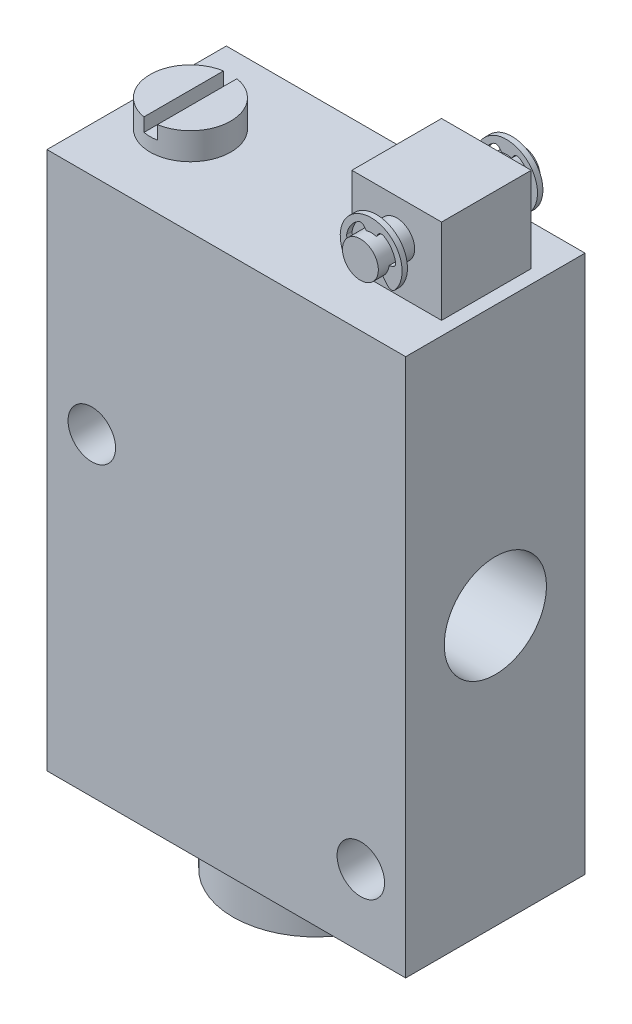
ISO-10303-21;
HEADER;
FILE_DESCRIPTION(('STEP AP214'),'2;1');
FILE_NAME('part.step','',(''),(''),'','','');
FILE_SCHEMA(('AUTOMOTIVE_DESIGN { 1 0 10303 214 1 1 1 1 }'));
ENDSEC;
DATA;
#1=APPLICATION_CONTEXT('core data for automotive mechanical design processes');
#2=APPLICATION_PROTOCOL_DEFINITION('international standard','automotive_design',2000,#1);
#3=PRODUCT_CONTEXT('',#1,'mechanical');
#4=PRODUCT('Part','Part','',(#3));
#5=PRODUCT_RELATED_PRODUCT_CATEGORY('part','',(#4));
#6=PRODUCT_DEFINITION_FORMATION('','',#4);
#7=PRODUCT_DEFINITION_CONTEXT('part definition',#1,'design');
#8=PRODUCT_DEFINITION('design','',#6,#7);
#9=PRODUCT_DEFINITION_SHAPE('','',#8);
#10=(LENGTH_UNIT() NAMED_UNIT(*) SI_UNIT(.MILLI.,.METRE.));
#11=(NAMED_UNIT(*) PLANE_ANGLE_UNIT() SI_UNIT($,.RADIAN.));
#12=(NAMED_UNIT(*) SI_UNIT($,.STERADIAN.) SOLID_ANGLE_UNIT());
#13=UNCERTAINTY_MEASURE_WITH_UNIT(LENGTH_MEASURE(1.E-05),#10,'distance_accuracy_value','');
#14=(GEOMETRIC_REPRESENTATION_CONTEXT(3) GLOBAL_UNCERTAINTY_ASSIGNED_CONTEXT((#13)) GLOBAL_UNIT_ASSIGNED_CONTEXT((#10,
#11,#12)) REPRESENTATION_CONTEXT('',''));
#15=CARTESIAN_POINT('',(0.,0.,0.));
#16=DIRECTION('',(0.,0.,1.));
#17=DIRECTION('',(1.,0.,0.));
#18=AXIS2_PLACEMENT_3D('',#15,#16,#17);
#19=CARTESIAN_POINT('',(-14.,63.,0.));
#20=DIRECTION('',(0.,-1.,0.));
#21=DIRECTION('',(0.,0.,-1.));
#22=AXIS2_PLACEMENT_3D('',#19,#20,#21);
#23=PLANE('',#22);
#24=CARTESIAN_POINT('',(-14.,63.,0.));
#25=DIRECTION('',(0.,-1.,0.));
#26=DIRECTION('',(0.,0.,-1.));
#27=AXIS2_PLACEMENT_3D('',#24,#25,#26);
#28=CIRCLE('',#27,4.5);
#29=CARTESIAN_POINT('',(-13.25,63.,-4.43705983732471));
#30=VERTEX_POINT('',#29);
#31=CARTESIAN_POINT('',(-13.25,63.,4.43705983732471));
#32=VERTEX_POINT('',#31);
#33=EDGE_CURVE('E661',#30,#32,#28,.T.);
#34=ORIENTED_EDGE('',*,*,#33,.F.);
#35=DIRECTION('',(0.,0.,-1.));
#36=VECTOR('',#35,1.);
#37=CARTESIAN_POINT('',(-13.25,63.,-4.43705983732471));
#38=LINE('',#37,#36);
#39=EDGE_CURVE('E11',#32,#30,#38,.T.);
#40=ORIENTED_EDGE('',*,*,#39,.F.);
#41=EDGE_LOOP('',(#34,#40));
#42=FACE_BOUND('',#41,.T.);
#43=ADVANCED_FACE('F17',(#42),#23,.F.);
#44=CARTESIAN_POINT('',(-14.,63.,0.));
#45=DIRECTION('',(0.,-1.,0.));
#46=DIRECTION('',(0.,0.,-1.));
#47=AXIS2_PLACEMENT_3D('',#44,#45,#46);
#48=PLANE('',#47);
#49=CARTESIAN_POINT('',(-14.,63.,0.));
#50=DIRECTION('',(0.,-1.,0.));
#51=DIRECTION('',(0.,0.,-1.));
#52=AXIS2_PLACEMENT_3D('',#49,#50,#51);
#53=CIRCLE('',#52,4.5);
#54=CARTESIAN_POINT('',(-14.75,63.,4.43705983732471));
#55=VERTEX_POINT('',#54);
#56=CARTESIAN_POINT('',(-14.75,63.,-4.43705983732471));
#57=VERTEX_POINT('',#56);
#58=EDGE_CURVE('E475',#55,#57,#53,.T.);
#59=ORIENTED_EDGE('',*,*,#58,.F.);
#60=DIRECTION('',(0.,0.,1.));
#61=VECTOR('',#60,1.);
#62=CARTESIAN_POINT('',(-14.75,63.,4.43705983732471));
#63=LINE('',#62,#61);
#64=EDGE_CURVE('E702',#57,#55,#63,.T.);
#65=ORIENTED_EDGE('',*,*,#64,.F.);
#66=EDGE_LOOP('',(#59,#65));
#67=FACE_BOUND('',#66,.T.);
#68=ADVANCED_FACE('F1314',(#67),#48,.F.);
#69=CARTESIAN_POINT('',(-14.,61.5,0.));
#70=DIRECTION('',(0.,1.,0.));
#71=DIRECTION('',(1.,0.,0.));
#72=AXIS2_PLACEMENT_3D('',#69,#70,#71);
#73=PLANE('',#72);
#74=DIRECTION('',(0.,0.,1.));
#75=VECTOR('',#74,1.);
#76=CARTESIAN_POINT('',(-14.75,61.5,-7.1619111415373));
#77=LINE('',#76,#75);
#78=CARTESIAN_POINT('',(-14.75,61.5,-4.43705983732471));
#79=VERTEX_POINT('',#78);
#80=CARTESIAN_POINT('',(-14.75,61.5,4.43705983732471));
#81=VERTEX_POINT('',#80);
#82=EDGE_CURVE('E705',#79,#81,#77,.T.);
#83=ORIENTED_EDGE('',*,*,#82,.T.);
#84=CARTESIAN_POINT('',(-14.,61.5,0.));
#85=DIRECTION('',(0.,-1.,0.));
#86=DIRECTION('',(0.,0.,1.));
#87=AXIS2_PLACEMENT_3D('',#84,#85,#86);
#88=CIRCLE('',#87,4.5);
#89=CARTESIAN_POINT('',(-13.25,61.5,4.43705983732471));
#90=VERTEX_POINT('',#89);
#91=EDGE_CURVE('E632',#90,#81,#88,.T.);
#92=ORIENTED_EDGE('',*,*,#91,.F.);
#93=DIRECTION('',(0.,0.,-1.));
#94=VECTOR('',#93,1.);
#95=CARTESIAN_POINT('',(-13.25,61.5,-7.1619111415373));
#96=LINE('',#95,#94);
#97=CARTESIAN_POINT('',(-13.25,61.5,-4.43705983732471));
#98=VERTEX_POINT('',#97);
#99=EDGE_CURVE('E27',#90,#98,#96,.T.);
#100=ORIENTED_EDGE('',*,*,#99,.T.);
#101=CARTESIAN_POINT('',(-14.,61.5,0.));
#102=DIRECTION('',(0.,-1.,0.));
#103=DIRECTION('',(0.,0.,1.));
#104=AXIS2_PLACEMENT_3D('',#101,#102,#103);
#105=CIRCLE('',#104,4.5);
#106=EDGE_CURVE('E474',#79,#98,#105,.T.);
#107=ORIENTED_EDGE('',*,*,#106,.F.);
#108=EDGE_LOOP('',(#83,#92,#100,#107));
#109=FACE_BOUND('',#108,.T.);
#110=ADVANCED_FACE('F1320',(#109),#73,.T.);
#111=CARTESIAN_POINT('',(-13.25,61.5,-7.1619111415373));
#112=DIRECTION('',(1.,0.,0.));
#113=DIRECTION('',(0.,0.,-1.));
#114=AXIS2_PLACEMENT_3D('',#111,#112,#113);
#115=PLANE('',#114);
#116=DIRECTION('',(0.,-1.,0.));
#117=VECTOR('',#116,1.);
#118=CARTESIAN_POINT('',(-13.25,81.2560801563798,-4.43705983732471));
#119=LINE('',#118,#117);
#120=EDGE_CURVE('E644',#30,#98,#119,.T.);
#121=ORIENTED_EDGE('',*,*,#120,.T.);
#122=ORIENTED_EDGE('',*,*,#99,.F.);
#123=DIRECTION('',(0.,1.,0.));
#124=VECTOR('',#123,1.);
#125=CARTESIAN_POINT('',(-13.25,81.2560801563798,4.43705983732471));
#126=LINE('',#125,#124);
#127=EDGE_CURVE('E656',#90,#32,#126,.T.);
#128=ORIENTED_EDGE('',*,*,#127,.T.);
#129=ORIENTED_EDGE('',*,*,#39,.T.);
#130=EDGE_LOOP('',(#121,#122,#128,#129));
#131=FACE_BOUND('',#130,.T.);
#132=ADVANCED_FACE('F1349',(#131),#115,.F.);
#133=CARTESIAN_POINT('',(-14.75,61.5,-7.1619111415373));
#134=DIRECTION('',(-1.,0.,0.));
#135=DIRECTION('',(0.,1.,0.));
#136=AXIS2_PLACEMENT_3D('',#133,#134,#135);
#137=PLANE('',#136);
#138=DIRECTION('',(0.,-1.,0.));
#139=VECTOR('',#138,1.);
#140=CARTESIAN_POINT('',(-14.75,81.2560801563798,4.43705983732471));
#141=LINE('',#140,#139);
#142=EDGE_CURVE('E675',#55,#81,#141,.T.);
#143=ORIENTED_EDGE('',*,*,#142,.T.);
#144=ORIENTED_EDGE('',*,*,#82,.F.);
#145=DIRECTION('',(0.,1.,0.));
#146=VECTOR('',#145,1.);
#147=CARTESIAN_POINT('',(-14.75,81.2560801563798,-4.43705983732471));
#148=LINE('',#147,#146);
#149=EDGE_CURVE('E470',#79,#57,#148,.T.);
#150=ORIENTED_EDGE('',*,*,#149,.T.);
#151=ORIENTED_EDGE('',*,*,#64,.T.);
#152=EDGE_LOOP('',(#143,#144,#150,#151));
#153=FACE_BOUND('',#152,.T.);
#154=ADVANCED_FACE('F1352',(#153),#137,.F.);
#155=CARTESIAN_POINT('',(-8.,0.,14.0533333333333));
#156=DIRECTION('',(-1.,0.,0.));
#157=DIRECTION('',(0.,0.,1.));
#158=AXIS2_PLACEMENT_3D('',#155,#156,#157);
#159=PLANE('',#158);
#160=DIRECTION('',(0.,-1.,0.));
#161=VECTOR('',#160,1.);
#162=CARTESIAN_POINT('',(-8.,-4.5,-4.64354390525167));
#163=LINE('',#162,#161);
#164=CARTESIAN_POINT('',(-8.,0.,-4.64354390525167));
#165=VERTEX_POINT('',#164);
#166=CARTESIAN_POINT('',(-8.,-4.5,-4.64354390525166));
#167=VERTEX_POINT('',#166);
#168=EDGE_CURVE('E849',#165,#167,#163,.T.);
#169=ORIENTED_EDGE('',*,*,#168,.T.);
#170=DIRECTION('',(0.,0.,-1.));
#171=VECTOR('',#170,1.);
#172=CARTESIAN_POINT('',(-8.,-4.5,4.64354390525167));
#173=LINE('',#172,#171);
#174=CARTESIAN_POINT('',(-8.,-4.5,4.64354390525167));
#175=VERTEX_POINT('',#174);
#176=EDGE_CURVE('E41',#175,#167,#173,.T.);
#177=ORIENTED_EDGE('',*,*,#176,.F.);
#178=DIRECTION('',(0.,1.,0.));
#179=VECTOR('',#178,1.);
#180=CARTESIAN_POINT('',(-8.,-4.5,4.64354390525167));
#181=LINE('',#180,#179);
#182=CARTESIAN_POINT('',(-8.,0.,4.64354390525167));
#183=VERTEX_POINT('',#182);
#184=EDGE_CURVE('E415',#175,#183,#181,.T.);
#185=ORIENTED_EDGE('',*,*,#184,.T.);
#186=DIRECTION('',(0.,0.,-1.));
#187=VECTOR('',#186,1.);
#188=CARTESIAN_POINT('',(-8.,0.,14.0533333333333));
#189=LINE('',#188,#187);
#190=EDGE_CURVE('E781',#183,#165,#189,.T.);
#191=ORIENTED_EDGE('',*,*,#190,.T.);
#192=EDGE_LOOP('',(#169,#177,#185,#191));
#193=FACE_BOUND('',#192,.T.);
#194=ADVANCED_FACE('F1359',(#193),#159,.T.);
#195=CARTESIAN_POINT('',(8.,0.,14.0533333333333));
#196=DIRECTION('',(1.,0.,0.));
#197=DIRECTION('',(0.,0.,1.));
#198=AXIS2_PLACEMENT_3D('',#195,#196,#197);
#199=PLANE('',#198);
#200=DIRECTION('',(0.,-1.,0.));
#201=VECTOR('',#200,1.);
#202=CARTESIAN_POINT('',(8.,-4.5,4.64354390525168));
#203=LINE('',#202,#201);
#204=CARTESIAN_POINT('',(8.,0.,4.64354390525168));
#205=VERTEX_POINT('',#204);
#206=CARTESIAN_POINT('',(8.,-4.5,4.64354390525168));
#207=VERTEX_POINT('',#206);
#208=EDGE_CURVE('E755',#205,#207,#203,.T.);
#209=ORIENTED_EDGE('',*,*,#208,.T.);
#210=DIRECTION('',(0.,0.,1.));
#211=VECTOR('',#210,1.);
#212=CARTESIAN_POINT('',(8.,-4.5,-4.64354390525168));
#213=LINE('',#212,#211);
#214=CARTESIAN_POINT('',(8.,-4.5,-4.64354390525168));
#215=VERTEX_POINT('',#214);
#216=EDGE_CURVE('E708',#215,#207,#213,.T.);
#217=ORIENTED_EDGE('',*,*,#216,.F.);
#218=DIRECTION('',(0.,1.,0.));
#219=VECTOR('',#218,1.);
#220=CARTESIAN_POINT('',(8.,-4.5,-4.64354390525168));
#221=LINE('',#220,#219);
#222=CARTESIAN_POINT('',(8.,0.,-4.64354390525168));
#223=VERTEX_POINT('',#222);
#224=EDGE_CURVE('E381',#215,#223,#221,.T.);
#225=ORIENTED_EDGE('',*,*,#224,.T.);
#226=DIRECTION('',(0.,0.,1.));
#227=VECTOR('',#226,1.);
#228=CARTESIAN_POINT('',(8.,0.,14.0533333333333));
#229=LINE('',#228,#227);
#230=EDGE_CURVE('E694',#223,#205,#229,.T.);
#231=ORIENTED_EDGE('',*,*,#230,.T.);
#232=EDGE_LOOP('',(#209,#217,#225,#231));
#233=FACE_BOUND('',#232,.T.);
#234=ADVANCED_FACE('F1375',(#233),#199,.T.);
#235=CARTESIAN_POINT('',(0.,-4.5,0.));
#236=DIRECTION('',(0.,1.,0.));
#237=DIRECTION('',(1.,0.,0.));
#238=AXIS2_PLACEMENT_3D('',#235,#236,#237);
#239=PLANE('',#238);
#240=CARTESIAN_POINT('',(0.,-4.5,0.));
#241=DIRECTION('',(0.,-1.,0.));
#242=DIRECTION('',(0.,0.,-1.));
#243=AXIS2_PLACEMENT_3D('',#240,#241,#242);
#244=CIRCLE('',#243,9.25);
#245=EDGE_CURVE('E412',#207,#175,#244,.T.);
#246=ORIENTED_EDGE('',*,*,#245,.T.);
#247=ORIENTED_EDGE('',*,*,#176,.T.);
#248=CARTESIAN_POINT('',(0.,-4.5,0.));
#249=DIRECTION('',(0.,-1.,0.));
#250=DIRECTION('',(0.,0.,-1.));
#251=AXIS2_PLACEMENT_3D('',#248,#249,#250);
#252=CIRCLE('',#251,9.25);
#253=EDGE_CURVE('E852',#167,#215,#252,.T.);
#254=ORIENTED_EDGE('',*,*,#253,.T.);
#255=ORIENTED_EDGE('',*,*,#216,.T.);
#256=EDGE_LOOP('',(#246,#247,#254,#255));
#257=FACE_BOUND('',#256,.T.);
#258=ADVANCED_FACE('F1378',(#257),#239,.F.);
#259=CARTESIAN_POINT('',(0.,-4.5,0.));
#260=DIRECTION('',(0.,-1.,0.));
#261=DIRECTION('',(0.,0.,-1.));
#262=AXIS2_PLACEMENT_3D('',#259,#260,#261);
#263=CYLINDRICAL_SURFACE('',#262,9.25);
#264=ORIENTED_EDGE('',*,*,#208,.F.);
#265=CARTESIAN_POINT('',(0.,0.,0.));
#266=DIRECTION('',(0.,-1.,0.));
#267=DIRECTION('',(0.,0.,1.));
#268=AXIS2_PLACEMENT_3D('',#265,#266,#267);
#269=CIRCLE('',#268,9.25);
#270=EDGE_CURVE('E784',#205,#183,#269,.T.);
#271=ORIENTED_EDGE('',*,*,#270,.T.);
#272=ORIENTED_EDGE('',*,*,#184,.F.);
#273=ORIENTED_EDGE('',*,*,#245,.F.);
#274=EDGE_LOOP('',(#264,#271,#272,#273));
#275=FACE_BOUND('',#274,.T.);
#276=ADVANCED_FACE('F1474',(#275),#263,.T.);
#277=CARTESIAN_POINT('',(-11.5,-30.4795013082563,-10.));
#278=DIRECTION('',(-1.,0.,0.));
#279=DIRECTION('',(0.,1.,0.));
#280=AXIS2_PLACEMENT_3D('',#277,#278,#279);
#281=PLANE('',#280);
#282=CARTESIAN_POINT('',(-11.5,11.5,0.));
#283=DIRECTION('',(1.,0.,0.));
#284=DIRECTION('',(0.,0.,1.));
#285=AXIS2_PLACEMENT_3D('',#282,#283,#284);
#286=CIRCLE('',#285,5.7);
#287=CARTESIAN_POINT('',(-11.5,11.5,-5.7));
#288=VERTEX_POINT('',#287);
#289=EDGE_CURVE('E680',#288,#288,#286,.T.);
#290=ORIENTED_EDGE('',*,*,#289,.F.);
#291=EDGE_LOOP('',(#290));
#292=FACE_BOUND('',#291,.T.);
#293=ADVANCED_FACE('F1477',(#292),#281,.T.);
#294=CARTESIAN_POINT('',(11.5,-30.4795013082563,-10.));
#295=DIRECTION('',(1.,0.,0.));
#296=DIRECTION('',(0.,1.,0.));
#297=AXIS2_PLACEMENT_3D('',#294,#295,#296);
#298=PLANE('',#297);
#299=CARTESIAN_POINT('',(11.5,30.,0.));
#300=DIRECTION('',(-1.,0.,0.));
#301=DIRECTION('',(0.,0.,-1.));
#302=AXIS2_PLACEMENT_3D('',#299,#300,#301);
#303=CIRCLE('',#302,5.7);
#304=CARTESIAN_POINT('',(11.5,30.,5.7));
#305=VERTEX_POINT('',#304);
#306=EDGE_CURVE('E593',#305,#305,#303,.T.);
#307=ORIENTED_EDGE('',*,*,#306,.F.);
#308=EDGE_LOOP('',(#307));
#309=FACE_BOUND('',#308,.T.);
#310=ADVANCED_FACE('F1434',(#309),#298,.T.);
#311=CARTESIAN_POINT('',(0.,0.,0.));
#312=DIRECTION('',(0.,1.,0.));
#313=DIRECTION('',(1.,0.,0.));
#314=AXIS2_PLACEMENT_3D('',#311,#312,#313);
#315=PLANE('',#314);
#316=ORIENTED_EDGE('',*,*,#230,.F.);
#317=CARTESIAN_POINT('',(0.,0.,0.));
#318=DIRECTION('',(0.,-1.,0.));
#319=DIRECTION('',(0.,0.,1.));
#320=AXIS2_PLACEMENT_3D('',#317,#318,#319);
#321=CIRCLE('',#320,9.25);
#322=EDGE_CURVE('E660',#165,#223,#321,.T.);
#323=ORIENTED_EDGE('',*,*,#322,.F.);
#324=ORIENTED_EDGE('',*,*,#190,.F.);
#325=ORIENTED_EDGE('',*,*,#270,.F.);
#326=EDGE_LOOP('',(#316,#323,#324,#325));
#327=FACE_BOUND('',#326,.T.);
#328=DIRECTION('',(0.,0.,-1.));
#329=VECTOR('',#328,1.);
#330=CARTESIAN_POINT('',(20.,0.,-10.));
#331=LINE('',#330,#329);
#332=CARTESIAN_POINT('',(20.,0.,10.));
#333=VERTEX_POINT('',#332);
#334=CARTESIAN_POINT('',(20.,0.,-10.));
#335=VERTEX_POINT('',#334);
#336=EDGE_CURVE('E749',#333,#335,#331,.T.);
#337=ORIENTED_EDGE('',*,*,#336,.F.);
#338=DIRECTION('',(1.,0.,0.));
#339=VECTOR('',#338,1.);
#340=CARTESIAN_POINT('',(-20.,0.,10.));
#341=LINE('',#340,#339);
#342=CARTESIAN_POINT('',(-20.,0.,10.));
#343=VERTEX_POINT('',#342);
#344=EDGE_CURVE('E497',#343,#333,#341,.T.);
#345=ORIENTED_EDGE('',*,*,#344,.F.);
#346=DIRECTION('',(0.,0.,1.));
#347=VECTOR('',#346,1.);
#348=CARTESIAN_POINT('',(-20.,0.,-10.));
#349=LINE('',#348,#347);
#350=CARTESIAN_POINT('',(-20.,0.,-10.));
#351=VERTEX_POINT('',#350);
#352=EDGE_CURVE('E937',#351,#343,#349,.T.);
#353=ORIENTED_EDGE('',*,*,#352,.F.);
#354=DIRECTION('',(-1.,0.,0.));
#355=VECTOR('',#354,1.);
#356=CARTESIAN_POINT('',(-20.,0.,-10.));
#357=LINE('',#356,#355);
#358=EDGE_CURVE('E690',#335,#351,#357,.T.);
#359=ORIENTED_EDGE('',*,*,#358,.F.);
#360=EDGE_LOOP('',(#337,#345,#353,#359));
#361=FACE_BOUND('',#360,.T.);
#362=ADVANCED_FACE('F1423',(#327,#361),#315,.F.);
#363=CARTESIAN_POINT('',(-20.,60.,-10.));
#364=DIRECTION('',(0.,0.,1.));
#365=DIRECTION('',(1.,0.,0.));
#366=AXIS2_PLACEMENT_3D('',#363,#364,#365);
#367=PLANE('',#366);
#368=CARTESIAN_POINT('',(-15.,35.,-10.));
#369=DIRECTION('',(0.,0.,1.));
#370=DIRECTION('',(1.,0.,0.));
#371=AXIS2_PLACEMENT_3D('',#368,#369,#370);
#372=CIRCLE('',#371,2.65);
#373=CARTESIAN_POINT('',(-12.35,35.,-10.));
#374=VERTEX_POINT('',#373);
#375=EDGE_CURVE('E588',#374,#374,#372,.T.);
#376=ORIENTED_EDGE('',*,*,#375,.T.);
#377=EDGE_LOOP('',(#376));
#378=FACE_BOUND('',#377,.T.);
#379=CARTESIAN_POINT('',(15.,8.,-10.));
#380=DIRECTION('',(0.,0.,1.));
#381=DIRECTION('',(1.,0.,0.));
#382=AXIS2_PLACEMENT_3D('',#379,#380,#381);
#383=CIRCLE('',#382,2.65);
#384=CARTESIAN_POINT('',(17.65,8.,-10.));
#385=VERTEX_POINT('',#384);
#386=EDGE_CURVE('E587',#385,#385,#383,.T.);
#387=ORIENTED_EDGE('',*,*,#386,.T.);
#388=EDGE_LOOP('',(#387));
#389=FACE_BOUND('',#388,.T.);
#390=ORIENTED_EDGE('',*,*,#358,.T.);
#391=DIRECTION('',(0.,-1.,0.));
#392=VECTOR('',#391,1.);
#393=CARTESIAN_POINT('',(-20.,60.,-10.));
#394=LINE('',#393,#392);
#395=CARTESIAN_POINT('',(-20.,60.,-10.));
#396=VERTEX_POINT('',#395);
#397=EDGE_CURVE('E498',#396,#351,#394,.T.);
#398=ORIENTED_EDGE('',*,*,#397,.F.);
#399=DIRECTION('',(-1.,0.,0.));
#400=VECTOR('',#399,1.);
#401=CARTESIAN_POINT('',(-20.,60.,-10.));
#402=LINE('',#401,#400);
#403=CARTESIAN_POINT('',(20.,60.,-10.));
#404=VERTEX_POINT('',#403);
#405=EDGE_CURVE('E826',#404,#396,#402,.T.);
#406=ORIENTED_EDGE('',*,*,#405,.F.);
#407=DIRECTION('',(0.,-1.,0.));
#408=VECTOR('',#407,1.);
#409=CARTESIAN_POINT('',(20.,60.,-10.));
#410=LINE('',#409,#408);
#411=EDGE_CURVE('E695',#404,#335,#410,.T.);
#412=ORIENTED_EDGE('',*,*,#411,.T.);
#413=EDGE_LOOP('',(#390,#398,#406,#412));
#414=FACE_BOUND('',#413,.T.);
#415=ADVANCED_FACE('F1419',(#378,#389,#414),#367,.F.);
#416=CARTESIAN_POINT('',(20.,60.,-10.));
#417=DIRECTION('',(-1.,0.,0.));
#418=DIRECTION('',(0.,1.,0.));
#419=AXIS2_PLACEMENT_3D('',#416,#417,#418);
#420=PLANE('',#419);
#421=CARTESIAN_POINT('',(20.,30.,0.));
#422=DIRECTION('',(1.,0.,0.));
#423=DIRECTION('',(0.,0.,-1.));
#424=AXIS2_PLACEMENT_3D('',#421,#422,#423);
#425=CIRCLE('',#424,5.7);
#426=CARTESIAN_POINT('',(20.,30.,-5.7));
#427=VERTEX_POINT('',#426);
#428=EDGE_CURVE('E597',#427,#427,#425,.T.);
#429=ORIENTED_EDGE('',*,*,#428,.F.);
#430=EDGE_LOOP('',(#429));
#431=FACE_BOUND('',#430,.T.);
#432=ORIENTED_EDGE('',*,*,#336,.T.);
#433=ORIENTED_EDGE('',*,*,#411,.F.);
#434=DIRECTION('',(0.,0.,-1.));
#435=VECTOR('',#434,1.);
#436=CARTESIAN_POINT('',(20.,60.,-10.));
#437=LINE('',#436,#435);
#438=CARTESIAN_POINT('',(20.,60.,10.));
#439=VERTEX_POINT('',#438);
#440=EDGE_CURVE('E820',#439,#404,#437,.T.);
#441=ORIENTED_EDGE('',*,*,#440,.F.);
#442=DIRECTION('',(0.,-1.,0.));
#443=VECTOR('',#442,1.);
#444=CARTESIAN_POINT('',(20.,60.,10.));
#445=LINE('',#444,#443);
#446=EDGE_CURVE('E493',#439,#333,#445,.T.);
#447=ORIENTED_EDGE('',*,*,#446,.T.);
#448=EDGE_LOOP('',(#432,#433,#441,#447));
#449=FACE_BOUND('',#448,.T.);
#450=ADVANCED_FACE('F1422',(#431,#449),#420,.F.);
#451=CARTESIAN_POINT('',(-20.,60.,10.));
#452=DIRECTION('',(0.,0.,-1.));
#453=DIRECTION('',(0.,-1.,0.));
#454=AXIS2_PLACEMENT_3D('',#451,#452,#453);
#455=PLANE('',#454);
#456=CARTESIAN_POINT('',(-15.,35.,10.));
#457=DIRECTION('',(0.,0.,1.));
#458=DIRECTION('',(1.,0.,0.));
#459=AXIS2_PLACEMENT_3D('',#456,#457,#458);
#460=CIRCLE('',#459,2.65);
#461=CARTESIAN_POINT('',(-12.35,35.,10.));
#462=VERTEX_POINT('',#461);
#463=EDGE_CURVE('E584',#462,#462,#460,.T.);
#464=ORIENTED_EDGE('',*,*,#463,.F.);
#465=EDGE_LOOP('',(#464));
#466=FACE_BOUND('',#465,.T.);
#467=CARTESIAN_POINT('',(15.,8.,10.));
#468=DIRECTION('',(0.,0.,1.));
#469=DIRECTION('',(1.,0.,0.));
#470=AXIS2_PLACEMENT_3D('',#467,#468,#469);
#471=CIRCLE('',#470,2.65);
#472=CARTESIAN_POINT('',(17.65,8.,10.));
#473=VERTEX_POINT('',#472);
#474=EDGE_CURVE('E598',#473,#473,#471,.T.);
#475=ORIENTED_EDGE('',*,*,#474,.F.);
#476=EDGE_LOOP('',(#475));
#477=FACE_BOUND('',#476,.T.);
#478=ORIENTED_EDGE('',*,*,#446,.F.);
#479=DIRECTION('',(1.,0.,0.));
#480=VECTOR('',#479,1.);
#481=CARTESIAN_POINT('',(-20.,60.,10.));
#482=LINE('',#481,#480);
#483=CARTESIAN_POINT('',(-20.,60.,10.));
#484=VERTEX_POINT('',#483);
#485=EDGE_CURVE('E463',#484,#439,#482,.T.);
#486=ORIENTED_EDGE('',*,*,#485,.F.);
#487=DIRECTION('',(0.,-1.,0.));
#488=VECTOR('',#487,1.);
#489=CARTESIAN_POINT('',(-20.,60.,10.));
#490=LINE('',#489,#488);
#491=EDGE_CURVE('E941',#484,#343,#490,.T.);
#492=ORIENTED_EDGE('',*,*,#491,.T.);
#493=ORIENTED_EDGE('',*,*,#344,.T.);
#494=EDGE_LOOP('',(#478,#486,#492,#493));
#495=FACE_BOUND('',#494,.T.);
#496=ADVANCED_FACE('F1438',(#466,#477,#495),#455,.F.);
#497=CARTESIAN_POINT('',(-20.,60.,-10.));
#498=DIRECTION('',(1.,0.,0.));
#499=DIRECTION('',(0.,0.,-1.));
#500=AXIS2_PLACEMENT_3D('',#497,#498,#499);
#501=PLANE('',#500);
#502=CARTESIAN_POINT('',(-20.,11.5,0.));
#503=DIRECTION('',(-1.,0.,0.));
#504=DIRECTION('',(0.,0.,1.));
#505=AXIS2_PLACEMENT_3D('',#502,#503,#504);
#506=CIRCLE('',#505,5.7);
#507=CARTESIAN_POINT('',(-20.,11.5,5.7));
#508=VERTEX_POINT('',#507);
#509=EDGE_CURVE('E454',#508,#508,#506,.T.);
#510=ORIENTED_EDGE('',*,*,#509,.F.);
#511=EDGE_LOOP('',(#510));
#512=FACE_BOUND('',#511,.T.);
#513=CARTESIAN_POINT('',(-20.,46.,0.));
#514=DIRECTION('',(-1.,0.,0.));
#515=DIRECTION('',(0.,0.,1.));
#516=AXIS2_PLACEMENT_3D('',#513,#514,#515);
#517=CIRCLE('',#516,5.7);
#518=CARTESIAN_POINT('',(-20.,46.,5.7));
#519=VERTEX_POINT('',#518);
#520=EDGE_CURVE('E453',#519,#519,#517,.T.);
#521=ORIENTED_EDGE('',*,*,#520,.F.);
#522=EDGE_LOOP('',(#521));
#523=FACE_BOUND('',#522,.T.);
#524=ORIENTED_EDGE('',*,*,#352,.T.);
#525=ORIENTED_EDGE('',*,*,#491,.F.);
#526=DIRECTION('',(0.,0.,1.));
#527=VECTOR('',#526,1.);
#528=CARTESIAN_POINT('',(-20.,60.,-10.));
#529=LINE('',#528,#527);
#530=EDGE_CURVE('E830',#396,#484,#529,.T.);
#531=ORIENTED_EDGE('',*,*,#530,.F.);
#532=ORIENTED_EDGE('',*,*,#397,.T.);
#533=EDGE_LOOP('',(#524,#525,#531,#532));
#534=FACE_BOUND('',#533,.T.);
#535=ADVANCED_FACE('F1332',(#512,#523,#534),#501,.F.);
#536=CARTESIAN_POINT('',(0.,60.,0.));
#537=DIRECTION('',(0.,1.,0.));
#538=DIRECTION('',(1.,0.,0.));
#539=AXIS2_PLACEMENT_3D('',#536,#537,#538);
#540=PLANE('',#539);
#541=CARTESIAN_POINT('',(-14.,60.,0.));
#542=DIRECTION('',(0.,1.,0.));
#543=DIRECTION('',(0.,0.,1.));
#544=AXIS2_PLACEMENT_3D('',#541,#542,#543);
#545=CIRCLE('',#544,4.5);
#546=CARTESIAN_POINT('',(-14.,60.,-4.5));
#547=VERTEX_POINT('',#546);
#548=EDGE_CURVE('E629',#547,#547,#545,.T.);
#549=ORIENTED_EDGE('',*,*,#548,.F.);
#550=EDGE_LOOP('',(#549));
#551=FACE_BOUND('',#550,.T.);
#552=CARTESIAN_POINT('',(14.,60.,0.));
#553=DIRECTION('',(0.,1.,0.));
#554=DIRECTION('',(0.,0.,1.));
#555=AXIS2_PLACEMENT_3D('',#552,#553,#554);
#556=CIRCLE('',#555,4.5);
#557=CARTESIAN_POINT('',(9.5,60.,0.));
#558=VERTEX_POINT('',#557);
#559=EDGE_CURVE('E433',#558,#558,#556,.T.);
#560=ORIENTED_EDGE('',*,*,#559,.F.);
#561=EDGE_LOOP('',(#560));
#562=FACE_BOUND('',#561,.T.);
#563=ORIENTED_EDGE('',*,*,#485,.T.);
#564=ORIENTED_EDGE('',*,*,#440,.T.);
#565=ORIENTED_EDGE('',*,*,#405,.T.);
#566=ORIENTED_EDGE('',*,*,#530,.T.);
#567=EDGE_LOOP('',(#563,#564,#565,#566));
#568=FACE_BOUND('',#567,.T.);
#569=ADVANCED_FACE('F1328',(#551,#562,#568),#540,.T.);
#570=CARTESIAN_POINT('',(-11.5,-30.4795013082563,-10.));
#571=DIRECTION('',(-1.,0.,0.));
#572=DIRECTION('',(0.,1.,0.));
#573=AXIS2_PLACEMENT_3D('',#570,#571,#572);
#574=PLANE('',#573);
#575=CARTESIAN_POINT('',(-11.5,46.,0.));
#576=DIRECTION('',(1.,0.,0.));
#577=DIRECTION('',(0.,0.,1.));
#578=AXIS2_PLACEMENT_3D('',#575,#576,#577);
#579=CIRCLE('',#578,5.7);
#580=CARTESIAN_POINT('',(-11.5,46.,-5.7));
#581=VERTEX_POINT('',#580);
#582=EDGE_CURVE('E449',#581,#581,#579,.T.);
#583=ORIENTED_EDGE('',*,*,#582,.F.);
#584=EDGE_LOOP('',(#583));
#585=FACE_BOUND('',#584,.T.);
#586=ADVANCED_FACE('F1331',(#585),#574,.T.);
#587=CARTESIAN_POINT('',(14.,65.9,-9.));
#588=DIRECTION('',(0.,0.,-1.));
#589=DIRECTION('',(0.,-1.,0.));
#590=AXIS2_PLACEMENT_3D('',#587,#588,#589);
#591=PLANE('',#590);
#592=CARTESIAN_POINT('',(14.,65.9,-9.));
#593=DIRECTION('',(0.,0.,-1.));
#594=DIRECTION('',(-1.,0.,0.));
#595=AXIS2_PLACEMENT_3D('',#592,#593,#594);
#596=CIRCLE('',#595,2.);
#597=CARTESIAN_POINT('',(12.,65.9,-9.));
#598=VERTEX_POINT('',#597);
#599=EDGE_CURVE('E360',#598,#598,#596,.T.);
#600=ORIENTED_EDGE('',*,*,#599,.T.);
#601=EDGE_LOOP('',(#600));
#602=FACE_BOUND('',#601,.T.);
#603=ADVANCED_FACE('F361',(#602),#591,.T.);
#604=CARTESIAN_POINT('',(14.,65.9,9.05));
#605=DIRECTION('',(0.,0.,1.));
#606=DIRECTION('',(1.,0.,0.));
#607=AXIS2_PLACEMENT_3D('',#604,#605,#606);
#608=PLANE('',#607);
#609=CARTESIAN_POINT('',(14.,65.9,9.05));
#610=DIRECTION('',(0.,0.,1.));
#611=DIRECTION('',(1.,0.,0.));
#612=AXIS2_PLACEMENT_3D('',#609,#610,#611);
#613=CIRCLE('',#612,2.);
#614=CARTESIAN_POINT('',(12.,65.9,9.05));
#615=VERTEX_POINT('',#614);
#616=EDGE_CURVE('E458',#615,#615,#613,.T.);
#617=ORIENTED_EDGE('',*,*,#616,.T.);
#618=EDGE_LOOP('',(#617));
#619=FACE_BOUND('',#618,.T.);
#620=ADVANCED_FACE('F1348',(#619),#608,.T.);
#621=CARTESIAN_POINT('',(12.0183325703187,65.2050221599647,-7.85));
#622=DIRECTION('',(0.,0.,1.));
#623=DIRECTION('',(1.,0.,0.));
#624=AXIS2_PLACEMENT_3D('',#621,#622,#623);
#625=PLANE('',#624);
#626=DIRECTION('',(0.581270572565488,0.813710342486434,0.));
#627=VECTOR('',#626,1.);
#628=CARTESIAN_POINT('',(14.7769808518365,68.1254975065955,-7.85));
#629=LINE('',#628,#627);
#630=CARTESIAN_POINT('',(14.5589653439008,67.8203014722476,-7.85));
#631=VERTEX_POINT('',#630);
#632=CARTESIAN_POINT('',(14.7769808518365,68.1254975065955,-7.85));
#633=VERTEX_POINT('',#632);
#634=EDGE_CURVE('E636',#631,#633,#629,.T.);
#635=ORIENTED_EDGE('',*,*,#634,.F.);
#636=CARTESIAN_POINT('',(14.,65.9,-7.85));
#637=DIRECTION('',(0.,0.,1.));
#638=DIRECTION('',(1.,0.,0.));
#639=AXIS2_PLACEMENT_3D('',#636,#637,#638);
#640=CIRCLE('',#639,2.);
#641=CARTESIAN_POINT('',(13.4410346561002,67.8203014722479,-7.85));
#642=VERTEX_POINT('',#641);
#643=EDGE_CURVE('E768',#631,#642,#640,.T.);
#644=ORIENTED_EDGE('',*,*,#643,.T.);
#645=DIRECTION('',(0.581270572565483,-0.813710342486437,0.));
#646=VECTOR('',#645,1.);
#647=CARTESIAN_POINT('',(13.2230191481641,68.1254975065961,-7.85));
#648=LINE('',#647,#646);
#649=CARTESIAN_POINT('',(13.2230191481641,68.1254975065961,-7.85));
#650=VERTEX_POINT('',#649);
#651=EDGE_CURVE('E794',#650,#642,#648,.T.);
#652=ORIENTED_EDGE('',*,*,#651,.F.);
#653=CARTESIAN_POINT('',(12.816163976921,67.8348622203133,-7.85));
#654=DIRECTION('',(0.,0.,-1.));
#655=DIRECTION('',(-1.,0.,0.));
#656=AXIS2_PLACEMENT_3D('',#653,#654,#655);
#657=CIRCLE('',#656,0.499999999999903);
#658=CARTESIAN_POINT('',(12.5552110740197,68.2613637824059,-7.85));
#659=VERTEX_POINT('',#658);
#660=EDGE_CURVE('E383',#659,#650,#657,.T.);
#661=ORIENTED_EDGE('',*,*,#660,.F.);
#662=CARTESIAN_POINT('',(14.,65.9,-7.85));
#663=DIRECTION('',(0.,0.,-1.));
#664=DIRECTION('',(1.,0.,0.));
#665=AXIS2_PLACEMENT_3D('',#662,#663,#664);
#666=CIRCLE('',#665,2.76829441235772);
#667=CARTESIAN_POINT('',(11.2728929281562,66.375753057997,-7.85));
#668=VERTEX_POINT('',#667);
#669=EDGE_CURVE('E426',#668,#659,#666,.T.);
#670=ORIENTED_EDGE('',*,*,#669,.F.);
#671=CARTESIAN_POINT('',(11.765453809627,66.2898241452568,-7.85));
#672=DIRECTION('',(0.,0.,-1.));
#673=DIRECTION('',(-1.,0.,0.));
#674=AXIS2_PLACEMENT_3D('',#671,#672,#673);
#675=CIRCLE('',#674,0.499999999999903);
#676=CARTESIAN_POINT('',(11.6528658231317,65.8026650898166,-7.85));
#677=VERTEX_POINT('',#676);
#678=EDGE_CURVE('E575',#677,#668,#675,.T.);
#679=ORIENTED_EDGE('',*,*,#678,.F.);
#680=DIRECTION('',(-0.974318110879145,0.225175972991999,0.));
#681=VECTOR('',#680,1.);
#682=CARTESIAN_POINT('',(11.6528658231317,65.8026650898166,-7.85));
#683=LINE('',#682,#681);
#684=CARTESIAN_POINT('',(12.0080646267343,65.7205746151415,-7.85));
#685=VERTEX_POINT('',#684);
#686=EDGE_CURVE('E447',#685,#677,#683,.T.);
#687=ORIENTED_EDGE('',*,*,#686,.F.);
#688=CARTESIAN_POINT('',(14.,65.9,-7.85));
#689=DIRECTION('',(0.,0.,1.));
#690=DIRECTION('',(1.,0.,0.));
#691=AXIS2_PLACEMENT_3D('',#688,#689,#690);
#692=CIRCLE('',#691,2.);
#693=CARTESIAN_POINT('',(12.7132214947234,64.3689215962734,-7.85));
#694=VERTEX_POINT('',#693);
#695=EDGE_CURVE('E365',#685,#694,#692,.T.);
#696=ORIENTED_EDGE('',*,*,#695,.T.);
#697=CARTESIAN_POINT('',(12.3059431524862,64.6589635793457,-7.85));
#698=DIRECTION('',(0.,0.,1.));
#699=DIRECTION('',(1.,0.,0.));
#700=AXIS2_PLACEMENT_3D('',#697,#698,#699);
#701=CIRCLE('',#700,0.499999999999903);
#702=CARTESIAN_POINT('',(12.6889653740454,64.3375697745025,-7.85));
#703=VERTEX_POINT('',#702);
#704=EDGE_CURVE('E404',#703,#694,#701,.T.);
#705=ORIENTED_EDGE('',*,*,#704,.F.);
#706=DIRECTION('',(0.642787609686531,0.766044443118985,0.));
#707=VECTOR('',#706,1.);
#708=CARTESIAN_POINT('',(12.6889653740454,64.3375697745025,-7.85));
#709=LINE('',#708,#707);
#710=CARTESIAN_POINT('',(12.1312117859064,63.6728649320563,-7.85));
#711=VERTEX_POINT('',#710);
#712=EDGE_CURVE('E874',#711,#703,#709,.T.);
#713=ORIENTED_EDGE('',*,*,#712,.F.);
#714=CARTESIAN_POINT('',(11.7481895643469,63.9942587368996,-7.85));
#715=DIRECTION('',(0.,0.,1.));
#716=DIRECTION('',(-1.,0.,0.));
#717=AXIS2_PLACEMENT_3D('',#714,#715,#716);
#718=CIRCLE('',#717,0.499999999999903);
#719=CARTESIAN_POINT('',(11.3665267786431,63.6712517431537,-7.85));
#720=VERTEX_POINT('',#719);
#721=EDGE_CURVE('E701',#720,#711,#718,.T.);
#722=ORIENTED_EDGE('',*,*,#721,.F.);
#723=CARTESIAN_POINT('',(14.,65.9,-7.85));
#724=DIRECTION('',(0.,0.,1.));
#725=DIRECTION('',(1.,0.,0.));
#726=AXIS2_PLACEMENT_3D('',#723,#724,#725);
#727=CIRCLE('',#726,3.44999999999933);
#728=CARTESIAN_POINT('',(16.633473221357,63.6712517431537,-7.85));
#729=VERTEX_POINT('',#728);
#730=EDGE_CURVE('E542',#729,#720,#727,.T.);
#731=ORIENTED_EDGE('',*,*,#730,.F.);
#732=CARTESIAN_POINT('',(16.2518104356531,63.9942587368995,-7.85));
#733=DIRECTION('',(0.,0.,1.));
#734=DIRECTION('',(-1.,0.,0.));
#735=AXIS2_PLACEMENT_3D('',#732,#733,#734);
#736=CIRCLE('',#735,0.499999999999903);
#737=CARTESIAN_POINT('',(15.8687882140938,63.6728649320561,-7.85));
#738=VERTEX_POINT('',#737);
#739=EDGE_CURVE('E762',#738,#729,#736,.T.);
#740=ORIENTED_EDGE('',*,*,#739,.F.);
#741=DIRECTION('',(0.642787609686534,-0.766044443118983,0.));
#742=VECTOR('',#741,1.);
#743=CARTESIAN_POINT('',(15.3110346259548,64.3375697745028,-7.85));
#744=LINE('',#743,#742);
#745=CARTESIAN_POINT('',(15.3110346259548,64.3375697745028,-7.85));
#746=VERTEX_POINT('',#745);
#747=EDGE_CURVE('E510',#746,#738,#744,.T.);
#748=ORIENTED_EDGE('',*,*,#747,.F.);
#749=CARTESIAN_POINT('',(15.6940568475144,64.6589635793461,-7.85));
#750=DIRECTION('',(0.,0.,1.));
#751=DIRECTION('',(-1.,0.,0.));
#752=AXIS2_PLACEMENT_3D('',#749,#750,#751);
#753=CIRCLE('',#752,0.499999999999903);
#754=CARTESIAN_POINT('',(15.2867785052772,64.3689215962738,-7.85));
#755=VERTEX_POINT('',#754);
#756=EDGE_CURVE('E628',#755,#746,#753,.T.);
#757=ORIENTED_EDGE('',*,*,#756,.F.);
#758=CARTESIAN_POINT('',(14.,65.9,-7.85));
#759=DIRECTION('',(0.,0.,1.));
#760=DIRECTION('',(1.,0.,0.));
#761=AXIS2_PLACEMENT_3D('',#758,#759,#760);
#762=CIRCLE('',#761,2.);
#763=CARTESIAN_POINT('',(15.9919353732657,65.7205746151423,-7.85));
#764=VERTEX_POINT('',#763);
#765=EDGE_CURVE('E421',#755,#764,#762,.T.);
#766=ORIENTED_EDGE('',*,*,#765,.T.);
#767=DIRECTION('',(-0.974318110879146,-0.225175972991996,0.));
#768=VECTOR('',#767,1.);
#769=CARTESIAN_POINT('',(16.347134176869,65.8026650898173,-7.85));
#770=LINE('',#769,#768);
#771=CARTESIAN_POINT('',(16.347134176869,65.8026650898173,-7.85));
#772=VERTEX_POINT('',#771);
#773=EDGE_CURVE('E568',#772,#764,#770,.T.);
#774=ORIENTED_EDGE('',*,*,#773,.F.);
#775=CARTESIAN_POINT('',(16.2345461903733,66.2898241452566,-7.85));
#776=DIRECTION('',(0.,0.,-1.));
#777=DIRECTION('',(-1.,0.,0.));
#778=AXIS2_PLACEMENT_3D('',#775,#776,#777);
#779=CIRCLE('',#778,0.499999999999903);
#780=CARTESIAN_POINT('',(16.7271070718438,66.375753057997,-7.85));
#781=VERTEX_POINT('',#780);
#782=EDGE_CURVE('E511',#781,#772,#779,.T.);
#783=ORIENTED_EDGE('',*,*,#782,.F.);
#784=CARTESIAN_POINT('',(14.,65.9,-7.85));
#785=DIRECTION('',(0.,0.,-1.));
#786=DIRECTION('',(1.,0.,0.));
#787=AXIS2_PLACEMENT_3D('',#784,#785,#786);
#788=CIRCLE('',#787,2.76829441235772);
#789=CARTESIAN_POINT('',(15.4447889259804,68.2613637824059,-7.85));
#790=VERTEX_POINT('',#789);
#791=EDGE_CURVE('E890',#790,#781,#788,.T.);
#792=ORIENTED_EDGE('',*,*,#791,.F.);
#793=CARTESIAN_POINT('',(15.1838360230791,67.8348622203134,-7.85));
#794=DIRECTION('',(0.,0.,-1.));
#795=DIRECTION('',(-1.,0.,0.));
#796=AXIS2_PLACEMENT_3D('',#793,#794,#795);
#797=CIRCLE('',#796,0.499999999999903);
#798=EDGE_CURVE('E521',#633,#790,#797,.T.);
#799=ORIENTED_EDGE('',*,*,#798,.F.);
#800=EDGE_LOOP('',(#635,#644,#652,#661,#670,#679,#687,#696,#705,#713,#722,#731,#740,#748,#757,
#766,#774,#783,#792,#799));
#801=FACE_BOUND('',#800,.T.);
#802=ADVANCED_FACE('F1068',(#801),#625,.F.);
#803=CARTESIAN_POINT('',(12.0183325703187,65.2050221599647,-7.25));
#804=DIRECTION('',(0.,0.,1.));
#805=DIRECTION('',(1.,0.,0.));
#806=AXIS2_PLACEMENT_3D('',#803,#804,#805);
#807=PLANE('',#806);
#808=DIRECTION('',(0.581270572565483,-0.813710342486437,0.));
#809=VECTOR('',#808,1.);
#810=CARTESIAN_POINT('',(13.2230191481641,68.1254975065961,-7.25));
#811=LINE('',#810,#809);
#812=CARTESIAN_POINT('',(13.2230191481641,68.1254975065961,-7.25));
#813=VERTEX_POINT('',#812);
#814=CARTESIAN_POINT('',(13.4410346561,67.8203014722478,-7.25));
#815=VERTEX_POINT('',#814);
#816=EDGE_CURVE('E791',#813,#815,#811,.T.);
#817=ORIENTED_EDGE('',*,*,#816,.T.);
#818=CARTESIAN_POINT('',(14.,65.9,-7.25));
#819=DIRECTION('',(0.,0.,-1.));
#820=DIRECTION('',(-1.,0.,0.));
#821=AXIS2_PLACEMENT_3D('',#818,#819,#820);
#822=CIRCLE('',#821,2.);
#823=CARTESIAN_POINT('',(14.5589653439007,67.8203014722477,-7.25));
#824=VERTEX_POINT('',#823);
#825=EDGE_CURVE('E364',#815,#824,#822,.T.);
#826=ORIENTED_EDGE('',*,*,#825,.T.);
#827=DIRECTION('',(0.581270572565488,0.813710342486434,0.));
#828=VECTOR('',#827,1.);
#829=CARTESIAN_POINT('',(14.7769808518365,68.1254975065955,-7.25));
#830=LINE('',#829,#828);
#831=CARTESIAN_POINT('',(14.7769808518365,68.1254975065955,-7.25));
#832=VERTEX_POINT('',#831);
#833=EDGE_CURVE('E778',#824,#832,#830,.T.);
#834=ORIENTED_EDGE('',*,*,#833,.T.);
#835=CARTESIAN_POINT('',(15.1838360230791,67.8348622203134,-7.25));
#836=DIRECTION('',(0.,0.,-1.));
#837=DIRECTION('',(-1.,0.,0.));
#838=AXIS2_PLACEMENT_3D('',#835,#836,#837);
#839=CIRCLE('',#838,0.499999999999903);
#840=CARTESIAN_POINT('',(15.4447889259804,68.2613637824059,-7.25));
#841=VERTEX_POINT('',#840);
#842=EDGE_CURVE('E894',#832,#841,#839,.T.);
#843=ORIENTED_EDGE('',*,*,#842,.T.);
#844=CARTESIAN_POINT('',(14.,65.9,-7.25));
#845=DIRECTION('',(0.,0.,-1.));
#846=DIRECTION('',(1.,0.,0.));
#847=AXIS2_PLACEMENT_3D('',#844,#845,#846);
#848=CIRCLE('',#847,2.76829441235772);
#849=CARTESIAN_POINT('',(16.7271070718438,66.375753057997,-7.25));
#850=VERTEX_POINT('',#849);
#851=EDGE_CURVE('E516',#841,#850,#848,.T.);
#852=ORIENTED_EDGE('',*,*,#851,.T.);
#853=CARTESIAN_POINT('',(16.2345461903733,66.2898241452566,-7.25));
#854=DIRECTION('',(0.,0.,-1.));
#855=DIRECTION('',(-1.,0.,0.));
#856=AXIS2_PLACEMENT_3D('',#853,#854,#855);
#857=CIRCLE('',#856,0.499999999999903);
#858=CARTESIAN_POINT('',(16.347134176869,65.8026650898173,-7.25));
#859=VERTEX_POINT('',#858);
#860=EDGE_CURVE('E979',#850,#859,#857,.T.);
#861=ORIENTED_EDGE('',*,*,#860,.T.);
#862=DIRECTION('',(-0.974318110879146,-0.225175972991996,0.));
#863=VECTOR('',#862,1.);
#864=CARTESIAN_POINT('',(16.347134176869,65.8026650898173,-7.25));
#865=LINE('',#864,#863);
#866=CARTESIAN_POINT('',(15.9919353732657,65.7205746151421,-7.25));
#867=VERTEX_POINT('',#866);
#868=EDGE_CURVE('E563',#859,#867,#865,.T.);
#869=ORIENTED_EDGE('',*,*,#868,.T.);
#870=CARTESIAN_POINT('',(14.,65.9,-7.25));
#871=DIRECTION('',(0.,0.,-1.));
#872=DIRECTION('',(-1.,0.,0.));
#873=AXIS2_PLACEMENT_3D('',#870,#871,#872);
#874=CIRCLE('',#873,2.);
#875=CARTESIAN_POINT('',(15.2867785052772,64.3689215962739,-7.25));
#876=VERTEX_POINT('',#875);
#877=EDGE_CURVE('E718',#867,#876,#874,.T.);
#878=ORIENTED_EDGE('',*,*,#877,.T.);
#879=CARTESIAN_POINT('',(15.6940568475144,64.6589635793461,-7.25));
#880=DIRECTION('',(0.,0.,1.));
#881=DIRECTION('',(-1.,0.,0.));
#882=AXIS2_PLACEMENT_3D('',#879,#880,#881);
#883=CIRCLE('',#882,0.499999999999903);
#884=CARTESIAN_POINT('',(15.3110346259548,64.3375697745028,-7.25));
#885=VERTEX_POINT('',#884);
#886=EDGE_CURVE('E567',#876,#885,#883,.T.);
#887=ORIENTED_EDGE('',*,*,#886,.T.);
#888=DIRECTION('',(0.642787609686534,-0.766044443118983,0.));
#889=VECTOR('',#888,1.);
#890=CARTESIAN_POINT('',(15.3110346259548,64.3375697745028,-7.25));
#891=LINE('',#890,#889);
#892=CARTESIAN_POINT('',(15.8687882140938,63.6728649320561,-7.25));
#893=VERTEX_POINT('',#892);
#894=EDGE_CURVE('E509',#885,#893,#891,.T.);
#895=ORIENTED_EDGE('',*,*,#894,.T.);
#896=CARTESIAN_POINT('',(16.2518104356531,63.9942587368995,-7.25));
#897=DIRECTION('',(0.,0.,1.));
#898=DIRECTION('',(-1.,0.,0.));
#899=AXIS2_PLACEMENT_3D('',#896,#897,#898);
#900=CIRCLE('',#899,0.499999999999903);
#901=CARTESIAN_POINT('',(16.633473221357,63.6712517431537,-7.25));
#902=VERTEX_POINT('',#901);
#903=EDGE_CURVE('E759',#893,#902,#900,.T.);
#904=ORIENTED_EDGE('',*,*,#903,.T.);
#905=CARTESIAN_POINT('',(14.,65.9,-7.25));
#906=DIRECTION('',(0.,0.,1.));
#907=DIRECTION('',(1.,0.,0.));
#908=AXIS2_PLACEMENT_3D('',#905,#906,#907);
#909=CIRCLE('',#908,3.44999999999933);
#910=CARTESIAN_POINT('',(11.3665267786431,63.6712517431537,-7.25));
#911=VERTEX_POINT('',#910);
#912=EDGE_CURVE('E767',#902,#911,#909,.T.);
#913=ORIENTED_EDGE('',*,*,#912,.T.);
#914=CARTESIAN_POINT('',(11.7481895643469,63.9942587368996,-7.25));
#915=DIRECTION('',(0.,0.,1.));
#916=DIRECTION('',(-1.,0.,0.));
#917=AXIS2_PLACEMENT_3D('',#914,#915,#916);
#918=CIRCLE('',#917,0.499999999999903);
#919=CARTESIAN_POINT('',(12.1312117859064,63.6728649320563,-7.25));
#920=VERTEX_POINT('',#919);
#921=EDGE_CURVE('E700',#911,#920,#918,.T.);
#922=ORIENTED_EDGE('',*,*,#921,.T.);
#923=DIRECTION('',(0.642787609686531,0.766044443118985,0.));
#924=VECTOR('',#923,1.);
#925=CARTESIAN_POINT('',(12.6889653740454,64.3375697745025,-7.25));
#926=LINE('',#925,#924);
#927=CARTESIAN_POINT('',(12.6889653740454,64.3375697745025,-7.25));
#928=VERTEX_POINT('',#927);
#929=EDGE_CURVE('E400',#920,#928,#926,.T.);
#930=ORIENTED_EDGE('',*,*,#929,.T.);
#931=CARTESIAN_POINT('',(12.3059431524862,64.6589635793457,-7.25));
#932=DIRECTION('',(0.,0.,1.));
#933=DIRECTION('',(1.,0.,0.));
#934=AXIS2_PLACEMENT_3D('',#931,#932,#933);
#935=CIRCLE('',#934,0.499999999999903);
#936=CARTESIAN_POINT('',(12.7132214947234,64.3689215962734,-7.25));
#937=VERTEX_POINT('',#936);
#938=EDGE_CURVE('E459',#928,#937,#935,.T.);
#939=ORIENTED_EDGE('',*,*,#938,.T.);
#940=CARTESIAN_POINT('',(14.,65.9,-7.25));
#941=DIRECTION('',(0.,0.,-1.));
#942=DIRECTION('',(-1.,0.,0.));
#943=AXIS2_PLACEMENT_3D('',#940,#941,#942);
#944=CIRCLE('',#943,2.);
#945=CARTESIAN_POINT('',(12.008064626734,65.7205746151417,-7.25));
#946=VERTEX_POINT('',#945);
#947=EDGE_CURVE('E686',#937,#946,#944,.T.);
#948=ORIENTED_EDGE('',*,*,#947,.T.);
#949=DIRECTION('',(-0.974318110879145,0.225175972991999,0.));
#950=VECTOR('',#949,1.);
#951=CARTESIAN_POINT('',(11.6528658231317,65.8026650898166,-7.25));
#952=LINE('',#951,#950);
#953=CARTESIAN_POINT('',(11.6528658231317,65.8026650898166,-7.25));
#954=VERTEX_POINT('',#953);
#955=EDGE_CURVE('E444',#946,#954,#952,.T.);
#956=ORIENTED_EDGE('',*,*,#955,.T.);
#957=CARTESIAN_POINT('',(11.765453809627,66.2898241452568,-7.25));
#958=DIRECTION('',(0.,0.,-1.));
#959=DIRECTION('',(-1.,0.,0.));
#960=AXIS2_PLACEMENT_3D('',#957,#958,#959);
#961=CIRCLE('',#960,0.499999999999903);
#962=CARTESIAN_POINT('',(11.2728929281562,66.375753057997,-7.25));
#963=VERTEX_POINT('',#962);
#964=EDGE_CURVE('E576',#954,#963,#961,.T.);
#965=ORIENTED_EDGE('',*,*,#964,.T.);
#966=CARTESIAN_POINT('',(14.,65.9,-7.25));
#967=DIRECTION('',(0.,0.,-1.));
#968=DIRECTION('',(1.,0.,0.));
#969=AXIS2_PLACEMENT_3D('',#966,#967,#968);
#970=CIRCLE('',#969,2.76829441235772);
#971=CARTESIAN_POINT('',(12.5552110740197,68.2613637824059,-7.25));
#972=VERTEX_POINT('',#971);
#973=EDGE_CURVE('E387',#963,#972,#970,.T.);
#974=ORIENTED_EDGE('',*,*,#973,.T.);
#975=CARTESIAN_POINT('',(12.816163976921,67.8348622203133,-7.25));
#976=DIRECTION('',(0.,0.,-1.));
#977=DIRECTION('',(-1.,0.,0.));
#978=AXIS2_PLACEMENT_3D('',#975,#976,#977);
#979=CIRCLE('',#978,0.499999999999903);
#980=EDGE_CURVE('E840',#972,#813,#979,.T.);
#981=ORIENTED_EDGE('',*,*,#980,.T.);
#982=EDGE_LOOP('',(#817,#826,#834,#843,#852,#861,#869,#878,#887,#895,#904,#913,#922,#930,#939,
#948,#956,#965,#974,#981));
#983=FACE_BOUND('',#982,.T.);
#984=ADVANCED_FACE('F1462',(#983),#807,.T.);
#985=CARTESIAN_POINT('',(12.3059431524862,64.6589635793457,-7.25));
#986=DIRECTION('',(0.,0.,-1.));
#987=DIRECTION('',(-1.,0.,0.));
#988=AXIS2_PLACEMENT_3D('',#985,#986,#987);
#989=CYLINDRICAL_SURFACE('',#988,0.499999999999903);
#990=ORIENTED_EDGE('',*,*,#704,.T.);
#991=DIRECTION('',(0.,0.,1.));
#992=VECTOR('',#991,1.);
#993=CARTESIAN_POINT('',(12.7132214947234,64.3689215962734,0.0749999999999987));
#994=LINE('',#993,#992);
#995=EDGE_CURVE('E377',#694,#937,#994,.T.);
#996=ORIENTED_EDGE('',*,*,#995,.T.);
#997=ORIENTED_EDGE('',*,*,#938,.F.);
#998=DIRECTION('',(0.,0.,-1.));
#999=VECTOR('',#998,1.);
#1000=CARTESIAN_POINT('',(12.6889653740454,64.3375697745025,-7.25));
#1001=LINE('',#1000,#999);
#1002=EDGE_CURVE('E405',#928,#703,#1001,.T.);
#1003=ORIENTED_EDGE('',*,*,#1002,.T.);
#1004=EDGE_LOOP('',(#990,#996,#997,#1003));
#1005=FACE_BOUND('',#1004,.T.);
#1006=ADVANCED_FACE('F1458',(#1005),#989,.T.);
#1007=CARTESIAN_POINT('',(12.6889653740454,64.3375697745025,-7.25));
#1008=DIRECTION('',(-0.766044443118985,0.642787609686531,0.));
#1009=DIRECTION('',(0.,0.,1.));
#1010=AXIS2_PLACEMENT_3D('',#1007,#1008,#1009);
#1011=PLANE('',#1010);
#1012=ORIENTED_EDGE('',*,*,#712,.T.);
#1013=ORIENTED_EDGE('',*,*,#1002,.F.);
#1014=ORIENTED_EDGE('',*,*,#929,.F.);
#1015=DIRECTION('',(0.,0.,-1.));
#1016=VECTOR('',#1015,1.);
#1017=CARTESIAN_POINT('',(12.1312117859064,63.6728649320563,-7.25));
#1018=LINE('',#1017,#1016);
#1019=EDGE_CURVE('E696',#920,#711,#1018,.T.);
#1020=ORIENTED_EDGE('',*,*,#1019,.T.);
#1021=EDGE_LOOP('',(#1012,#1013,#1014,#1020));
#1022=FACE_BOUND('',#1021,.T.);
#1023=ADVANCED_FACE('F1365',(#1022),#1011,.F.);
#1024=CARTESIAN_POINT('',(11.7481895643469,63.9942587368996,-7.25));
#1025=DIRECTION('',(0.,0.,-1.));
#1026=DIRECTION('',(-1.,0.,0.));
#1027=AXIS2_PLACEMENT_3D('',#1024,#1025,#1026);
#1028=CYLINDRICAL_SURFACE('',#1027,0.499999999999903);
#1029=ORIENTED_EDGE('',*,*,#721,.T.);
#1030=ORIENTED_EDGE('',*,*,#1019,.F.);
#1031=ORIENTED_EDGE('',*,*,#921,.F.);
#1032=DIRECTION('',(0.,0.,-1.));
#1033=VECTOR('',#1032,1.);
#1034=CARTESIAN_POINT('',(11.3665267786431,63.6712517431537,-7.25));
#1035=LINE('',#1034,#1033);
#1036=EDGE_CURVE('E546',#911,#720,#1035,.T.);
#1037=ORIENTED_EDGE('',*,*,#1036,.T.);
#1038=EDGE_LOOP('',(#1029,#1030,#1031,#1037));
#1039=FACE_BOUND('',#1038,.T.);
#1040=ADVANCED_FACE('F1361',(#1039),#1028,.T.);
#1041=CARTESIAN_POINT('',(16.2518104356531,63.9942587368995,-7.25));
#1042=DIRECTION('',(0.,0.,-1.));
#1043=DIRECTION('',(-1.,0.,0.));
#1044=AXIS2_PLACEMENT_3D('',#1041,#1042,#1043);
#1045=CYLINDRICAL_SURFACE('',#1044,0.499999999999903);
#1046=ORIENTED_EDGE('',*,*,#739,.T.);
#1047=DIRECTION('',(0.,0.,-1.));
#1048=VECTOR('',#1047,1.);
#1049=CARTESIAN_POINT('',(16.633473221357,63.6712517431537,-7.25));
#1050=LINE('',#1049,#1048);
#1051=EDGE_CURVE('E547',#902,#729,#1050,.T.);
#1052=ORIENTED_EDGE('',*,*,#1051,.F.);
#1053=ORIENTED_EDGE('',*,*,#903,.F.);
#1054=DIRECTION('',(0.,0.,-1.));
#1055=VECTOR('',#1054,1.);
#1056=CARTESIAN_POINT('',(15.8687882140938,63.6728649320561,-7.25));
#1057=LINE('',#1056,#1055);
#1058=EDGE_CURVE('E505',#893,#738,#1057,.T.);
#1059=ORIENTED_EDGE('',*,*,#1058,.T.);
#1060=EDGE_LOOP('',(#1046,#1052,#1053,#1059));
#1061=FACE_BOUND('',#1060,.T.);
#1062=ADVANCED_FACE('F1364',(#1061),#1045,.T.);
#1063=CARTESIAN_POINT('',(15.3110346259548,64.3375697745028,-7.25));
#1064=DIRECTION('',(0.766044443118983,0.642787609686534,0.));
#1065=DIRECTION('',(0.,0.,-1.));
#1066=AXIS2_PLACEMENT_3D('',#1063,#1064,#1065);
#1067=PLANE('',#1066);
#1068=ORIENTED_EDGE('',*,*,#747,.T.);
#1069=ORIENTED_EDGE('',*,*,#1058,.F.);
#1070=ORIENTED_EDGE('',*,*,#894,.F.);
#1071=DIRECTION('',(0.,0.,-1.));
#1072=VECTOR('',#1071,1.);
#1073=CARTESIAN_POINT('',(15.3110346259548,64.3375697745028,-7.25));
#1074=LINE('',#1073,#1072);
#1075=EDGE_CURVE('E870',#885,#746,#1074,.T.);
#1076=ORIENTED_EDGE('',*,*,#1075,.T.);
#1077=EDGE_LOOP('',(#1068,#1069,#1070,#1076));
#1078=FACE_BOUND('',#1077,.T.);
#1079=ADVANCED_FACE('F1326',(#1078),#1067,.F.);
#1080=CARTESIAN_POINT('',(15.6940568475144,64.6589635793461,-7.25));
#1081=DIRECTION('',(0.,0.,-1.));
#1082=DIRECTION('',(-1.,0.,0.));
#1083=AXIS2_PLACEMENT_3D('',#1080,#1081,#1082);
#1084=CYLINDRICAL_SURFACE('',#1083,0.499999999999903);
#1085=ORIENTED_EDGE('',*,*,#886,.F.);
#1086=DIRECTION('',(0.,0.,-1.));
#1087=VECTOR('',#1086,1.);
#1088=CARTESIAN_POINT('',(15.2867785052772,64.3689215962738,0.0749999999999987));
#1089=LINE('',#1088,#1087);
#1090=EDGE_CURVE('E416',#876,#755,#1089,.T.);
#1091=ORIENTED_EDGE('',*,*,#1090,.T.);
#1092=ORIENTED_EDGE('',*,*,#756,.T.);
#1093=ORIENTED_EDGE('',*,*,#1075,.F.);
#1094=EDGE_LOOP('',(#1085,#1091,#1092,#1093));
#1095=FACE_BOUND('',#1094,.T.);
#1096=ADVANCED_FACE('F1398',(#1095),#1084,.T.);
#1097=CARTESIAN_POINT('',(16.347134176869,65.8026650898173,-7.25));
#1098=DIRECTION('',(0.225175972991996,-0.974318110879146,0.));
#1099=DIRECTION('',(0.,0.,-1.));
#1100=AXIS2_PLACEMENT_3D('',#1097,#1098,#1099);
#1101=PLANE('',#1100);
#1102=ORIENTED_EDGE('',*,*,#773,.T.);
#1103=DIRECTION('',(0.,0.,1.));
#1104=VECTOR('',#1103,1.);
#1105=CARTESIAN_POINT('',(15.9919353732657,65.7205746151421,-8.9));
#1106=LINE('',#1105,#1104);
#1107=EDGE_CURVE('E538',#764,#867,#1106,.T.);
#1108=ORIENTED_EDGE('',*,*,#1107,.T.);
#1109=ORIENTED_EDGE('',*,*,#868,.F.);
#1110=DIRECTION('',(0.,0.,-1.));
#1111=VECTOR('',#1110,1.);
#1112=CARTESIAN_POINT('',(16.347134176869,65.8026650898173,-7.25));
#1113=LINE('',#1112,#1111);
#1114=EDGE_CURVE('E515',#859,#772,#1113,.T.);
#1115=ORIENTED_EDGE('',*,*,#1114,.T.);
#1116=EDGE_LOOP('',(#1102,#1108,#1109,#1115));
#1117=FACE_BOUND('',#1116,.T.);
#1118=ADVANCED_FACE('F1394',(#1117),#1101,.F.);
#1119=CARTESIAN_POINT('',(16.2345461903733,66.2898241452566,-7.25));
#1120=DIRECTION('',(0.,0.,-1.));
#1121=DIRECTION('',(-1.,0.,0.));
#1122=AXIS2_PLACEMENT_3D('',#1119,#1120,#1121);
#1123=CYLINDRICAL_SURFACE('',#1122,0.499999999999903);
#1124=ORIENTED_EDGE('',*,*,#782,.T.);
#1125=ORIENTED_EDGE('',*,*,#1114,.F.);
#1126=ORIENTED_EDGE('',*,*,#860,.F.);
#1127=DIRECTION('',(0.,0.,-1.));
#1128=VECTOR('',#1127,1.);
#1129=CARTESIAN_POINT('',(16.7271070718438,66.375753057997,-7.25));
#1130=LINE('',#1129,#1128);
#1131=EDGE_CURVE('E608',#850,#781,#1130,.T.);
#1132=ORIENTED_EDGE('',*,*,#1131,.T.);
#1133=EDGE_LOOP('',(#1124,#1125,#1126,#1132));
#1134=FACE_BOUND('',#1133,.T.);
#1135=ADVANCED_FACE('F1397',(#1134),#1123,.F.);
#1136=CARTESIAN_POINT('',(14.,65.9,-7.25));
#1137=DIRECTION('',(0.,0.,-1.));
#1138=DIRECTION('',(-1.,0.,0.));
#1139=AXIS2_PLACEMENT_3D('',#1136,#1137,#1138);
#1140=CYLINDRICAL_SURFACE('',#1139,2.76829441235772);
#1141=ORIENTED_EDGE('',*,*,#791,.T.);
#1142=ORIENTED_EDGE('',*,*,#1131,.F.);
#1143=ORIENTED_EDGE('',*,*,#851,.F.);
#1144=DIRECTION('',(0.,0.,-1.));
#1145=VECTOR('',#1144,1.);
#1146=CARTESIAN_POINT('',(15.4447889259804,68.2613637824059,-7.25));
#1147=LINE('',#1146,#1145);
#1148=EDGE_CURVE('E525',#841,#790,#1147,.T.);
#1149=ORIENTED_EDGE('',*,*,#1148,.T.);
#1150=EDGE_LOOP('',(#1141,#1142,#1143,#1149));
#1151=FACE_BOUND('',#1150,.T.);
#1152=ADVANCED_FACE('F1487',(#1151),#1140,.F.);
#1153=CARTESIAN_POINT('',(15.1838360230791,67.8348622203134,-7.25));
#1154=DIRECTION('',(0.,0.,-1.));
#1155=DIRECTION('',(-1.,0.,0.));
#1156=AXIS2_PLACEMENT_3D('',#1153,#1154,#1155);
#1157=CYLINDRICAL_SURFACE('',#1156,0.499999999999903);
#1158=ORIENTED_EDGE('',*,*,#798,.T.);
#1159=ORIENTED_EDGE('',*,*,#1148,.F.);
#1160=ORIENTED_EDGE('',*,*,#842,.F.);
#1161=DIRECTION('',(0.,0.,-1.));
#1162=VECTOR('',#1161,1.);
#1163=CARTESIAN_POINT('',(14.7769808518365,68.1254975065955,-7.25));
#1164=LINE('',#1163,#1162);
#1165=EDGE_CURVE('E526',#832,#633,#1164,.T.);
#1166=ORIENTED_EDGE('',*,*,#1165,.T.);
#1167=EDGE_LOOP('',(#1158,#1159,#1160,#1166));
#1168=FACE_BOUND('',#1167,.T.);
#1169=ADVANCED_FACE('F1485',(#1168),#1157,.F.);
#1170=CARTESIAN_POINT('',(14.7769808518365,68.1254975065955,-7.25));
#1171=DIRECTION('',(-0.813710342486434,0.581270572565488,0.));
#1172=DIRECTION('',(0.,0.,1.));
#1173=AXIS2_PLACEMENT_3D('',#1170,#1171,#1172);
#1174=PLANE('',#1173);
#1175=ORIENTED_EDGE('',*,*,#833,.F.);
#1176=DIRECTION('',(0.,0.,-1.));
#1177=VECTOR('',#1176,1.);
#1178=CARTESIAN_POINT('',(14.5589653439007,67.8203014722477,-8.9));
#1179=LINE('',#1178,#1177);
#1180=EDGE_CURVE('E763',#824,#631,#1179,.T.);
#1181=ORIENTED_EDGE('',*,*,#1180,.T.);
#1182=ORIENTED_EDGE('',*,*,#634,.T.);
#1183=ORIENTED_EDGE('',*,*,#1165,.F.);
#1184=EDGE_LOOP('',(#1175,#1181,#1182,#1183));
#1185=FACE_BOUND('',#1184,.T.);
#1186=ADVANCED_FACE('F1413',(#1185),#1174,.F.);
#1187=CARTESIAN_POINT('',(13.2230191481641,68.1254975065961,-7.25));
#1188=DIRECTION('',(0.813710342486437,0.581270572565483,0.));
#1189=DIRECTION('',(0.,0.,-1.));
#1190=AXIS2_PLACEMENT_3D('',#1187,#1188,#1189);
#1191=PLANE('',#1190);
#1192=ORIENTED_EDGE('',*,*,#651,.T.);
#1193=DIRECTION('',(0.,0.,1.));
#1194=VECTOR('',#1193,1.);
#1195=CARTESIAN_POINT('',(13.4410346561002,67.8203014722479,-8.9));
#1196=LINE('',#1195,#1194);
#1197=EDGE_CURVE('E373',#642,#815,#1196,.T.);
#1198=ORIENTED_EDGE('',*,*,#1197,.T.);
#1199=ORIENTED_EDGE('',*,*,#816,.F.);
#1200=DIRECTION('',(0.,0.,-1.));
#1201=VECTOR('',#1200,1.);
#1202=CARTESIAN_POINT('',(13.2230191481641,68.1254975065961,-7.25));
#1203=LINE('',#1202,#1201);
#1204=EDGE_CURVE('E386',#813,#650,#1203,.T.);
#1205=ORIENTED_EDGE('',*,*,#1204,.T.);
#1206=EDGE_LOOP('',(#1192,#1198,#1199,#1205));
#1207=FACE_BOUND('',#1206,.T.);
#1208=ADVANCED_FACE('F1077',(#1207),#1191,.F.);
#1209=CARTESIAN_POINT('',(12.816163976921,67.8348622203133,-7.25));
#1210=DIRECTION('',(0.,0.,-1.));
#1211=DIRECTION('',(-1.,0.,0.));
#1212=AXIS2_PLACEMENT_3D('',#1209,#1210,#1211);
#1213=CYLINDRICAL_SURFACE('',#1212,0.499999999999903);
#1214=ORIENTED_EDGE('',*,*,#660,.T.);
#1215=ORIENTED_EDGE('',*,*,#1204,.F.);
#1216=ORIENTED_EDGE('',*,*,#980,.F.);
#1217=DIRECTION('',(0.,0.,-1.));
#1218=VECTOR('',#1217,1.);
#1219=CARTESIAN_POINT('',(12.5552110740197,68.2613637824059,-7.25));
#1220=LINE('',#1219,#1218);
#1221=EDGE_CURVE('E422',#972,#659,#1220,.T.);
#1222=ORIENTED_EDGE('',*,*,#1221,.T.);
#1223=EDGE_LOOP('',(#1214,#1215,#1216,#1222));
#1224=FACE_BOUND('',#1223,.T.);
#1225=ADVANCED_FACE('F1084',(#1224),#1213,.F.);
#1226=CARTESIAN_POINT('',(14.,65.9,-7.25));
#1227=DIRECTION('',(0.,0.,-1.));
#1228=DIRECTION('',(-1.,0.,0.));
#1229=AXIS2_PLACEMENT_3D('',#1226,#1227,#1228);
#1230=CYLINDRICAL_SURFACE('',#1229,2.76829441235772);
#1231=ORIENTED_EDGE('',*,*,#669,.T.);
#1232=ORIENTED_EDGE('',*,*,#1221,.F.);
#1233=ORIENTED_EDGE('',*,*,#973,.F.);
#1234=DIRECTION('',(0.,0.,-1.));
#1235=VECTOR('',#1234,1.);
#1236=CARTESIAN_POINT('',(11.2728929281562,66.375753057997,-7.25));
#1237=LINE('',#1236,#1235);
#1238=EDGE_CURVE('E604',#963,#668,#1237,.T.);
#1239=ORIENTED_EDGE('',*,*,#1238,.T.);
#1240=EDGE_LOOP('',(#1231,#1232,#1233,#1239));
#1241=FACE_BOUND('',#1240,.T.);
#1242=ADVANCED_FACE('F1427',(#1241),#1230,.F.);
#1243=CARTESIAN_POINT('',(11.6528658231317,65.8026650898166,-7.25));
#1244=DIRECTION('',(-0.225175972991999,-0.974318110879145,0.));
#1245=DIRECTION('',(-0.974318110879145,0.225175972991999,0.));
#1246=AXIS2_PLACEMENT_3D('',#1243,#1244,#1245);
#1247=PLANE('',#1246);
#1248=ORIENTED_EDGE('',*,*,#955,.F.);
#1249=DIRECTION('',(0.,0.,-1.));
#1250=VECTOR('',#1249,1.);
#1251=CARTESIAN_POINT('',(12.0080646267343,65.7205746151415,-8.9));
#1252=LINE('',#1251,#1250);
#1253=EDGE_CURVE('E420',#946,#685,#1252,.T.);
#1254=ORIENTED_EDGE('',*,*,#1253,.T.);
#1255=ORIENTED_EDGE('',*,*,#686,.T.);
#1256=DIRECTION('',(0.,0.,-1.));
#1257=VECTOR('',#1256,1.);
#1258=CARTESIAN_POINT('',(11.6528658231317,65.8026650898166,-7.25));
#1259=LINE('',#1258,#1257);
#1260=EDGE_CURVE('E571',#954,#677,#1259,.T.);
#1261=ORIENTED_EDGE('',*,*,#1260,.F.);
#1262=EDGE_LOOP('',(#1248,#1254,#1255,#1261));
#1263=FACE_BOUND('',#1262,.T.);
#1264=ADVANCED_FACE('F1402',(#1263),#1247,.F.);
#1265=CARTESIAN_POINT('',(12.0183325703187,65.2050221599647,7.25));
#1266=DIRECTION('',(0.,0.,1.));
#1267=DIRECTION('',(1.,0.,0.));
#1268=AXIS2_PLACEMENT_3D('',#1265,#1266,#1267);
#1269=PLANE('',#1268);
#1270=CARTESIAN_POINT('',(14.,65.9,7.25));
#1271=DIRECTION('',(0.,0.,-1.));
#1272=DIRECTION('',(-1.,0.,0.));
#1273=AXIS2_PLACEMENT_3D('',#1270,#1271,#1272);
#1274=CIRCLE('',#1273,2.);
#1275=CARTESIAN_POINT('',(13.4410346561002,67.8203014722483,7.25));
#1276=VERTEX_POINT('',#1275);
#1277=CARTESIAN_POINT('',(14.5589653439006,67.8203014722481,7.25));
#1278=VERTEX_POINT('',#1277);
#1279=EDGE_CURVE('E479',#1276,#1278,#1274,.T.);
#1280=ORIENTED_EDGE('',*,*,#1279,.F.);
#1281=DIRECTION('',(0.581270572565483,-0.813710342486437,0.));
#1282=VECTOR('',#1281,1.);
#1283=CARTESIAN_POINT('',(13.2230191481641,68.1254975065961,7.25));
#1284=LINE('',#1283,#1282);
#1285=CARTESIAN_POINT('',(13.2230191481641,68.1254975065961,7.25));
#1286=VERTEX_POINT('',#1285);
#1287=EDGE_CURVE('E431',#1286,#1276,#1284,.T.);
#1288=ORIENTED_EDGE('',*,*,#1287,.F.);
#1289=CARTESIAN_POINT('',(12.816163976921,67.8348622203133,7.25));
#1290=DIRECTION('',(0.,0.,-1.));
#1291=DIRECTION('',(-1.,0.,0.));
#1292=AXIS2_PLACEMENT_3D('',#1289,#1290,#1291);
#1293=CIRCLE('',#1292,0.499999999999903);
#1294=CARTESIAN_POINT('',(12.5552110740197,68.2613637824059,7.25));
#1295=VERTEX_POINT('',#1294);
#1296=EDGE_CURVE('E616',#1295,#1286,#1293,.T.);
#1297=ORIENTED_EDGE('',*,*,#1296,.F.);
#1298=CARTESIAN_POINT('',(14.,65.9,7.25));
#1299=DIRECTION('',(0.,0.,-1.));
#1300=DIRECTION('',(1.,0.,0.));
#1301=AXIS2_PLACEMENT_3D('',#1298,#1299,#1300);
#1302=CIRCLE('',#1301,2.76829441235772);
#1303=CARTESIAN_POINT('',(11.2728929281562,66.375753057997,7.25));
#1304=VERTEX_POINT('',#1303);
#1305=EDGE_CURVE('E464',#1304,#1295,#1302,.T.);
#1306=ORIENTED_EDGE('',*,*,#1305,.F.);
#1307=CARTESIAN_POINT('',(11.765453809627,66.2898241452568,7.25));
#1308=DIRECTION('',(0.,0.,-1.));
#1309=DIRECTION('',(-1.,0.,0.));
#1310=AXIS2_PLACEMENT_3D('',#1307,#1308,#1309);
#1311=CIRCLE('',#1310,0.499999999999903);
#1312=CARTESIAN_POINT('',(11.6528658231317,65.8026650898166,7.25));
#1313=VERTEX_POINT('',#1312);
#1314=EDGE_CURVE('E668',#1313,#1304,#1311,.T.);
#1315=ORIENTED_EDGE('',*,*,#1314,.F.);
#1316=DIRECTION('',(-0.974318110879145,0.225175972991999,0.));
#1317=VECTOR('',#1316,1.);
#1318=CARTESIAN_POINT('',(11.6528658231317,65.8026650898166,7.25));
#1319=LINE('',#1318,#1317);
#1320=CARTESIAN_POINT('',(12.008064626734,65.7205746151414,7.25));
#1321=VERTEX_POINT('',#1320);
#1322=EDGE_CURVE('E469',#1321,#1313,#1319,.T.);
#1323=ORIENTED_EDGE('',*,*,#1322,.F.);
#1324=CARTESIAN_POINT('',(14.,65.9,7.25));
#1325=DIRECTION('',(0.,0.,-1.));
#1326=DIRECTION('',(-1.,0.,0.));
#1327=AXIS2_PLACEMENT_3D('',#1324,#1325,#1326);
#1328=CIRCLE('',#1327,2.);
#1329=CARTESIAN_POINT('',(12.7132214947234,64.3689215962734,7.25));
#1330=VERTEX_POINT('',#1329);
#1331=EDGE_CURVE('E556',#1330,#1321,#1328,.T.);
#1332=ORIENTED_EDGE('',*,*,#1331,.F.);
#1333=CARTESIAN_POINT('',(12.3059431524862,64.6589635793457,7.25));
#1334=DIRECTION('',(0.,0.,1.));
#1335=DIRECTION('',(1.,0.,0.));
#1336=AXIS2_PLACEMENT_3D('',#1333,#1334,#1335);
#1337=CIRCLE('',#1336,0.499999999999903);
#1338=CARTESIAN_POINT('',(12.6889653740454,64.3375697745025,7.25));
#1339=VERTEX_POINT('',#1338);
#1340=EDGE_CURVE('E398',#1339,#1330,#1337,.T.);
#1341=ORIENTED_EDGE('',*,*,#1340,.F.);
#1342=DIRECTION('',(0.642787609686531,0.766044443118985,0.));
#1343=VECTOR('',#1342,1.);
#1344=CARTESIAN_POINT('',(12.6889653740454,64.3375697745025,7.25));
#1345=LINE('',#1344,#1343);
#1346=CARTESIAN_POINT('',(12.1312117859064,63.6728649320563,7.25));
#1347=VERTEX_POINT('',#1346);
#1348=EDGE_CURVE('E520',#1347,#1339,#1345,.T.);
#1349=ORIENTED_EDGE('',*,*,#1348,.F.);
#1350=CARTESIAN_POINT('',(11.7481895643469,63.9942587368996,7.25));
#1351=DIRECTION('',(0.,0.,1.));
#1352=DIRECTION('',(-1.,0.,0.));
#1353=AXIS2_PLACEMENT_3D('',#1350,#1351,#1352);
#1354=CIRCLE('',#1353,0.499999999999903);
#1355=CARTESIAN_POINT('',(11.3665267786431,63.6712517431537,7.25));
#1356=VERTEX_POINT('',#1355);
#1357=EDGE_CURVE('E883',#1356,#1347,#1354,.T.);
#1358=ORIENTED_EDGE('',*,*,#1357,.F.);
#1359=CARTESIAN_POINT('',(14.,65.9,7.25));
#1360=DIRECTION('',(0.,0.,1.));
#1361=DIRECTION('',(1.,0.,0.));
#1362=AXIS2_PLACEMENT_3D('',#1359,#1360,#1361);
#1363=CIRCLE('',#1362,3.44999999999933);
#1364=CARTESIAN_POINT('',(16.633473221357,63.6712517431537,7.25));
#1365=VERTEX_POINT('',#1364);
#1366=EDGE_CURVE('E727',#1365,#1356,#1363,.T.);
#1367=ORIENTED_EDGE('',*,*,#1366,.F.);
#1368=CARTESIAN_POINT('',(16.2518104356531,63.9942587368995,7.25));
#1369=DIRECTION('',(0.,0.,1.));
#1370=DIRECTION('',(-1.,0.,0.));
#1371=AXIS2_PLACEMENT_3D('',#1368,#1369,#1370);
#1372=CIRCLE('',#1371,0.499999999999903);
#1373=CARTESIAN_POINT('',(15.8687882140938,63.6728649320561,7.25));
#1374=VERTEX_POINT('',#1373);
#1375=EDGE_CURVE('E557',#1374,#1365,#1372,.T.);
#1376=ORIENTED_EDGE('',*,*,#1375,.F.);
#1377=DIRECTION('',(0.642787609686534,-0.766044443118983,0.));
#1378=VECTOR('',#1377,1.);
#1379=CARTESIAN_POINT('',(15.3110346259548,64.3375697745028,7.25));
#1380=LINE('',#1379,#1378);
#1381=CARTESIAN_POINT('',(15.3110346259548,64.3375697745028,7.25));
#1382=VERTEX_POINT('',#1381);
#1383=EDGE_CURVE('E652',#1382,#1374,#1380,.T.);
#1384=ORIENTED_EDGE('',*,*,#1383,.F.);
#1385=CARTESIAN_POINT('',(15.6940568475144,64.6589635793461,7.25));
#1386=DIRECTION('',(0.,0.,1.));
#1387=DIRECTION('',(-1.,0.,0.));
#1388=AXIS2_PLACEMENT_3D('',#1385,#1386,#1387);
#1389=CIRCLE('',#1388,0.499999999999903);
#1390=CARTESIAN_POINT('',(15.2867785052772,64.3689215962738,7.25));
#1391=VERTEX_POINT('',#1390);
#1392=EDGE_CURVE('E653',#1391,#1382,#1389,.T.);
#1393=ORIENTED_EDGE('',*,*,#1392,.F.);
#1394=CARTESIAN_POINT('',(14.,65.9,7.25));
#1395=DIRECTION('',(0.,0.,-1.));
#1396=DIRECTION('',(-1.,0.,0.));
#1397=AXIS2_PLACEMENT_3D('',#1394,#1395,#1396);
#1398=CIRCLE('',#1397,2.);
#1399=CARTESIAN_POINT('',(15.9919353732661,65.7205746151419,7.25));
#1400=VERTEX_POINT('',#1399);
#1401=EDGE_CURVE('E491',#1400,#1391,#1398,.T.);
#1402=ORIENTED_EDGE('',*,*,#1401,.F.);
#1403=DIRECTION('',(-0.974318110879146,-0.225175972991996,0.));
#1404=VECTOR('',#1403,1.);
#1405=CARTESIAN_POINT('',(16.347134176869,65.8026650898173,7.25));
#1406=LINE('',#1405,#1404);
#1407=CARTESIAN_POINT('',(16.347134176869,65.8026650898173,7.25));
#1408=VERTEX_POINT('',#1407);
#1409=EDGE_CURVE('E531',#1408,#1400,#1406,.T.);
#1410=ORIENTED_EDGE('',*,*,#1409,.F.);
#1411=CARTESIAN_POINT('',(16.2345461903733,66.2898241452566,7.25));
#1412=DIRECTION('',(0.,0.,-1.));
#1413=DIRECTION('',(-1.,0.,0.));
#1414=AXIS2_PLACEMENT_3D('',#1411,#1412,#1413);
#1415=CIRCLE('',#1414,0.499999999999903);
#1416=CARTESIAN_POINT('',(16.7271070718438,66.375753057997,7.25));
#1417=VERTEX_POINT('',#1416);
#1418=EDGE_CURVE('E443',#1417,#1408,#1415,.T.);
#1419=ORIENTED_EDGE('',*,*,#1418,.F.);
#1420=CARTESIAN_POINT('',(14.,65.9,7.25));
#1421=DIRECTION('',(0.,0.,-1.));
#1422=DIRECTION('',(1.,0.,0.));
#1423=AXIS2_PLACEMENT_3D('',#1420,#1421,#1422);
#1424=CIRCLE('',#1423,2.76829441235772);
#1425=CARTESIAN_POINT('',(15.4447889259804,68.2613637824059,7.25));
#1426=VERTEX_POINT('',#1425);
#1427=EDGE_CURVE('E481',#1426,#1417,#1424,.T.);
#1428=ORIENTED_EDGE('',*,*,#1427,.F.);
#1429=CARTESIAN_POINT('',(15.1838360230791,67.8348622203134,7.25));
#1430=DIRECTION('',(0.,0.,-1.));
#1431=DIRECTION('',(-1.,0.,0.));
#1432=AXIS2_PLACEMENT_3D('',#1429,#1430,#1431);
#1433=CIRCLE('',#1432,0.499999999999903);
#1434=CARTESIAN_POINT('',(14.7769808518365,68.1254975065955,7.25));
#1435=VERTEX_POINT('',#1434);
#1436=EDGE_CURVE('E709',#1435,#1426,#1433,.T.);
#1437=ORIENTED_EDGE('',*,*,#1436,.F.);
#1438=DIRECTION('',(0.581270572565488,0.813710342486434,0.));
#1439=VECTOR('',#1438,1.);
#1440=CARTESIAN_POINT('',(14.7769808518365,68.1254975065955,7.25));
#1441=LINE('',#1440,#1439);
#1442=EDGE_CURVE('E807',#1278,#1435,#1441,.T.);
#1443=ORIENTED_EDGE('',*,*,#1442,.F.);
#1444=EDGE_LOOP('',(#1280,#1288,#1297,#1306,#1315,#1323,#1332,#1341,#1349,#1358,#1367,#1376,
#1384,#1393,#1402,#1410,#1419,#1428,#1437,#1443));
#1445=FACE_BOUND('',#1444,.T.);
#1446=ADVANCED_FACE('F1173',(#1445),#1269,.F.);
#1447=CARTESIAN_POINT('',(12.0183325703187,65.2050221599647,7.85));
#1448=DIRECTION('',(0.,0.,1.));
#1449=DIRECTION('',(1.,0.,0.));
#1450=AXIS2_PLACEMENT_3D('',#1447,#1448,#1449);
#1451=PLANE('',#1450);
#1452=CARTESIAN_POINT('',(14.,65.9,7.85));
#1453=DIRECTION('',(0.,0.,1.));
#1454=DIRECTION('',(1.,0.,0.));
#1455=AXIS2_PLACEMENT_3D('',#1452,#1453,#1454);
#1456=CIRCLE('',#1455,2.);
#1457=CARTESIAN_POINT('',(14.5589653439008,67.8203014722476,7.85));
#1458=VERTEX_POINT('',#1457);
#1459=CARTESIAN_POINT('',(13.4410346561,67.8203014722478,7.85));
#1460=VERTEX_POINT('',#1459);
#1461=EDGE_CURVE('E813',#1458,#1460,#1456,.T.);
#1462=ORIENTED_EDGE('',*,*,#1461,.F.);
#1463=DIRECTION('',(0.581270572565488,0.813710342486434,0.));
#1464=VECTOR('',#1463,1.);
#1465=CARTESIAN_POINT('',(14.7769808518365,68.1254975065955,7.85));
#1466=LINE('',#1465,#1464);
#1467=CARTESIAN_POINT('',(14.7769808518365,68.1254975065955,7.85));
#1468=VERTEX_POINT('',#1467);
#1469=EDGE_CURVE('E800',#1458,#1468,#1466,.T.);
#1470=ORIENTED_EDGE('',*,*,#1469,.T.);
#1471=CARTESIAN_POINT('',(15.1838360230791,67.8348622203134,7.85));
#1472=DIRECTION('',(0.,0.,-1.));
#1473=DIRECTION('',(-1.,0.,0.));
#1474=AXIS2_PLACEMENT_3D('',#1471,#1472,#1473);
#1475=CIRCLE('',#1474,0.499999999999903);
#1476=CARTESIAN_POINT('',(15.4447889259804,68.2613637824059,7.85));
#1477=VERTEX_POINT('',#1476);
#1478=EDGE_CURVE('E486',#1468,#1477,#1475,.T.);
#1479=ORIENTED_EDGE('',*,*,#1478,.T.);
#1480=CARTESIAN_POINT('',(14.,65.9,7.85));
#1481=DIRECTION('',(0.,0.,-1.));
#1482=DIRECTION('',(1.,0.,0.));
#1483=AXIS2_PLACEMENT_3D('',#1480,#1481,#1482);
#1484=CIRCLE('',#1483,2.76829441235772);
#1485=CARTESIAN_POINT('',(16.7271070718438,66.375753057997,7.85));
#1486=VERTEX_POINT('',#1485);
#1487=EDGE_CURVE('E577',#1477,#1486,#1484,.T.);
#1488=ORIENTED_EDGE('',*,*,#1487,.T.);
#1489=CARTESIAN_POINT('',(16.2345461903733,66.2898241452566,7.85));
#1490=DIRECTION('',(0.,0.,-1.));
#1491=DIRECTION('',(-1.,0.,0.));
#1492=AXIS2_PLACEMENT_3D('',#1489,#1490,#1491);
#1493=CIRCLE('',#1492,0.499999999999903);
#1494=CARTESIAN_POINT('',(16.347134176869,65.8026650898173,7.85));
#1495=VERTEX_POINT('',#1494);
#1496=EDGE_CURVE('E442',#1486,#1495,#1493,.T.);
#1497=ORIENTED_EDGE('',*,*,#1496,.T.);
#1498=DIRECTION('',(-0.974318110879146,-0.225175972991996,0.));
#1499=VECTOR('',#1498,1.);
#1500=CARTESIAN_POINT('',(16.347134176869,65.8026650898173,7.85));
#1501=LINE('',#1500,#1499);
#1502=CARTESIAN_POINT('',(15.9919353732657,65.7205746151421,7.85));
#1503=VERTEX_POINT('',#1502);
#1504=EDGE_CURVE('E534',#1495,#1503,#1501,.T.);
#1505=ORIENTED_EDGE('',*,*,#1504,.T.);
#1506=CARTESIAN_POINT('',(14.,65.9,7.85));
#1507=DIRECTION('',(0.,0.,1.));
#1508=DIRECTION('',(1.,0.,0.));
#1509=AXIS2_PLACEMENT_3D('',#1506,#1507,#1508);
#1510=CIRCLE('',#1509,2.);
#1511=CARTESIAN_POINT('',(15.2867785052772,64.3689215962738,7.85));
#1512=VERTEX_POINT('',#1511);
#1513=EDGE_CURVE('E480',#1512,#1503,#1510,.T.);
#1514=ORIENTED_EDGE('',*,*,#1513,.F.);
#1515=CARTESIAN_POINT('',(15.6940568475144,64.6589635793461,7.85));
#1516=DIRECTION('',(0.,0.,1.));
#1517=DIRECTION('',(-1.,0.,0.));
#1518=AXIS2_PLACEMENT_3D('',#1515,#1516,#1517);
#1519=CIRCLE('',#1518,0.499999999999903);
#1520=CARTESIAN_POINT('',(15.3110346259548,64.3375697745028,7.85));
#1521=VERTEX_POINT('',#1520);
#1522=EDGE_CURVE('E583',#1512,#1521,#1519,.T.);
#1523=ORIENTED_EDGE('',*,*,#1522,.T.);
#1524=DIRECTION('',(0.642787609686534,-0.766044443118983,0.));
#1525=VECTOR('',#1524,1.);
#1526=CARTESIAN_POINT('',(15.3110346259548,64.3375697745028,7.85));
#1527=LINE('',#1526,#1525);
#1528=CARTESIAN_POINT('',(15.8687882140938,63.6728649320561,7.85));
#1529=VERTEX_POINT('',#1528);
#1530=EDGE_CURVE('E562',#1521,#1529,#1527,.T.);
#1531=ORIENTED_EDGE('',*,*,#1530,.T.);
#1532=CARTESIAN_POINT('',(16.2518104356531,63.9942587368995,7.85));
#1533=DIRECTION('',(0.,0.,1.));
#1534=DIRECTION('',(-1.,0.,0.));
#1535=AXIS2_PLACEMENT_3D('',#1532,#1533,#1534);
#1536=CIRCLE('',#1535,0.499999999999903);
#1537=CARTESIAN_POINT('',(16.633473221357,63.6712517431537,7.85));
#1538=VERTEX_POINT('',#1537);
#1539=EDGE_CURVE('E561',#1529,#1538,#1536,.T.);
#1540=ORIENTED_EDGE('',*,*,#1539,.T.);
#1541=CARTESIAN_POINT('',(14.,65.9,7.85));
#1542=DIRECTION('',(0.,0.,1.));
#1543=DIRECTION('',(1.,0.,0.));
#1544=AXIS2_PLACEMENT_3D('',#1541,#1542,#1543);
#1545=CIRCLE('',#1544,3.44999999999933);
#1546=CARTESIAN_POINT('',(11.3665267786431,63.6712517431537,7.85));
#1547=VERTEX_POINT('',#1546);
#1548=EDGE_CURVE('E599',#1538,#1547,#1545,.T.);
#1549=ORIENTED_EDGE('',*,*,#1548,.T.);
#1550=CARTESIAN_POINT('',(11.7481895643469,63.9942587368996,7.85));
#1551=DIRECTION('',(0.,0.,1.));
#1552=DIRECTION('',(-1.,0.,0.));
#1553=AXIS2_PLACEMENT_3D('',#1550,#1551,#1552);
#1554=CIRCLE('',#1553,0.499999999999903);
#1555=CARTESIAN_POINT('',(12.1312117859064,63.6728649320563,7.85));
#1556=VERTEX_POINT('',#1555);
#1557=EDGE_CURVE('E624',#1547,#1556,#1554,.T.);
#1558=ORIENTED_EDGE('',*,*,#1557,.T.);
#1559=DIRECTION('',(0.642787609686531,0.766044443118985,0.));
#1560=VECTOR('',#1559,1.);
#1561=CARTESIAN_POINT('',(12.6889653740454,64.3375697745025,7.85));
#1562=LINE('',#1561,#1560);
#1563=CARTESIAN_POINT('',(12.6889653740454,64.3375697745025,7.85));
#1564=VERTEX_POINT('',#1563);
#1565=EDGE_CURVE('E394',#1556,#1564,#1562,.T.);
#1566=ORIENTED_EDGE('',*,*,#1565,.T.);
#1567=CARTESIAN_POINT('',(12.3059431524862,64.6589635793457,7.85));
#1568=DIRECTION('',(0.,0.,1.));
#1569=DIRECTION('',(1.,0.,0.));
#1570=AXIS2_PLACEMENT_3D('',#1567,#1568,#1569);
#1571=CIRCLE('',#1570,0.499999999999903);
#1572=CARTESIAN_POINT('',(12.7132214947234,64.3689215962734,7.85));
#1573=VERTEX_POINT('',#1572);
#1574=EDGE_CURVE('E448',#1564,#1573,#1571,.T.);
#1575=ORIENTED_EDGE('',*,*,#1574,.T.);
#1576=CARTESIAN_POINT('',(14.,65.9,7.85));
#1577=DIRECTION('',(0.,0.,1.));
#1578=DIRECTION('',(1.,0.,0.));
#1579=AXIS2_PLACEMENT_3D('',#1576,#1577,#1578);
#1580=CIRCLE('',#1579,2.);
#1581=CARTESIAN_POINT('',(12.0080646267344,65.7205746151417,7.85));
#1582=VERTEX_POINT('',#1581);
#1583=EDGE_CURVE('E492',#1582,#1573,#1580,.T.);
#1584=ORIENTED_EDGE('',*,*,#1583,.F.);
#1585=DIRECTION('',(-0.974318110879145,0.225175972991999,0.));
#1586=VECTOR('',#1585,1.);
#1587=CARTESIAN_POINT('',(11.6528658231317,65.8026650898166,7.85));
#1588=LINE('',#1587,#1586);
#1589=CARTESIAN_POINT('',(11.6528658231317,65.8026650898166,7.85));
#1590=VERTEX_POINT('',#1589);
#1591=EDGE_CURVE('E612',#1582,#1590,#1588,.T.);
#1592=ORIENTED_EDGE('',*,*,#1591,.T.);
#1593=CARTESIAN_POINT('',(11.765453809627,66.2898241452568,7.85));
#1594=DIRECTION('',(0.,0.,-1.));
#1595=DIRECTION('',(-1.,0.,0.));
#1596=AXIS2_PLACEMENT_3D('',#1593,#1594,#1595);
#1597=CIRCLE('',#1596,0.499999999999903);
#1598=CARTESIAN_POINT('',(11.2728929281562,66.375753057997,7.85));
#1599=VERTEX_POINT('',#1598);
#1600=EDGE_CURVE('E662',#1590,#1599,#1597,.T.);
#1601=ORIENTED_EDGE('',*,*,#1600,.T.);
#1602=CARTESIAN_POINT('',(14.,65.9,7.85));
#1603=DIRECTION('',(0.,0.,-1.));
#1604=DIRECTION('',(1.,0.,0.));
#1605=AXIS2_PLACEMENT_3D('',#1602,#1603,#1604);
#1606=CIRCLE('',#1605,2.76829441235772);
#1607=CARTESIAN_POINT('',(12.5552110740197,68.2613637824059,7.85));
#1608=VERTEX_POINT('',#1607);
#1609=EDGE_CURVE('E530',#1599,#1608,#1606,.T.);
#1610=ORIENTED_EDGE('',*,*,#1609,.T.);
#1611=CARTESIAN_POINT('',(12.816163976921,67.8348622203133,7.85));
#1612=DIRECTION('',(0.,0.,-1.));
#1613=DIRECTION('',(-1.,0.,0.));
#1614=AXIS2_PLACEMENT_3D('',#1611,#1612,#1613);
#1615=CIRCLE('',#1614,0.499999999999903);
#1616=CARTESIAN_POINT('',(13.2230191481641,68.1254975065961,7.85));
#1617=VERTEX_POINT('',#1616);
#1618=EDGE_CURVE('E427',#1608,#1617,#1615,.T.);
#1619=ORIENTED_EDGE('',*,*,#1618,.T.);
#1620=DIRECTION('',(0.581270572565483,-0.813710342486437,0.));
#1621=VECTOR('',#1620,1.);
#1622=CARTESIAN_POINT('',(13.2230191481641,68.1254975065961,7.85));
#1623=LINE('',#1622,#1621);
#1624=EDGE_CURVE('E797',#1617,#1460,#1623,.T.);
#1625=ORIENTED_EDGE('',*,*,#1624,.T.);
#1626=EDGE_LOOP('',(#1462,#1470,#1479,#1488,#1497,#1505,#1514,#1523,#1531,#1540,#1549,#1558,
#1566,#1575,#1584,#1592,#1601,#1610,#1619,#1625));
#1627=FACE_BOUND('',#1626,.T.);
#1628=ADVANCED_FACE('F1165',(#1627),#1451,.T.);
#1629=CARTESIAN_POINT('',(12.3059431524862,64.6589635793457,7.85));
#1630=DIRECTION('',(0.,0.,-1.));
#1631=DIRECTION('',(-1.,0.,0.));
#1632=AXIS2_PLACEMENT_3D('',#1629,#1630,#1631);
#1633=CYLINDRICAL_SURFACE('',#1632,0.499999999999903);
#1634=ORIENTED_EDGE('',*,*,#1340,.T.);
#1635=DIRECTION('',(0.,0.,1.));
#1636=VECTOR('',#1635,1.);
#1637=CARTESIAN_POINT('',(12.7132214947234,64.3689215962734,0.0749999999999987));
#1638=LINE('',#1637,#1636);
#1639=EDGE_CURVE('E620',#1330,#1573,#1638,.T.);
#1640=ORIENTED_EDGE('',*,*,#1639,.T.);
#1641=ORIENTED_EDGE('',*,*,#1574,.F.);
#1642=DIRECTION('',(0.,0.,-1.));
#1643=VECTOR('',#1642,1.);
#1644=CARTESIAN_POINT('',(12.6889653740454,64.3375697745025,7.85));
#1645=LINE('',#1644,#1643);
#1646=EDGE_CURVE('E399',#1564,#1339,#1645,.T.);
#1647=ORIENTED_EDGE('',*,*,#1646,.T.);
#1648=EDGE_LOOP('',(#1634,#1640,#1641,#1647));
#1649=FACE_BOUND('',#1648,.T.);
#1650=ADVANCED_FACE('F1374',(#1649),#1633,.T.);
#1651=CARTESIAN_POINT('',(12.6889653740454,64.3375697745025,7.85));
#1652=DIRECTION('',(-0.766044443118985,0.642787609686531,0.));
#1653=DIRECTION('',(0.,0.,1.));
#1654=AXIS2_PLACEMENT_3D('',#1651,#1652,#1653);
#1655=PLANE('',#1654);
#1656=ORIENTED_EDGE('',*,*,#1348,.T.);
#1657=ORIENTED_EDGE('',*,*,#1646,.F.);
#1658=ORIENTED_EDGE('',*,*,#1565,.F.);
#1659=DIRECTION('',(0.,0.,-1.));
#1660=VECTOR('',#1659,1.);
#1661=CARTESIAN_POINT('',(12.1312117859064,63.6728649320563,7.85));
#1662=LINE('',#1661,#1660);
#1663=EDGE_CURVE('E731',#1556,#1347,#1662,.T.);
#1664=ORIENTED_EDGE('',*,*,#1663,.T.);
#1665=EDGE_LOOP('',(#1656,#1657,#1658,#1664));
#1666=FACE_BOUND('',#1665,.T.);
#1667=ADVANCED_FACE('F1389',(#1666),#1655,.F.);
#1668=CARTESIAN_POINT('',(11.7481895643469,63.9942587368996,7.85));
#1669=DIRECTION('',(0.,0.,-1.));
#1670=DIRECTION('',(-1.,0.,0.));
#1671=AXIS2_PLACEMENT_3D('',#1668,#1669,#1670);
#1672=CYLINDRICAL_SURFACE('',#1671,0.499999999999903);
#1673=ORIENTED_EDGE('',*,*,#1357,.T.);
#1674=ORIENTED_EDGE('',*,*,#1663,.F.);
#1675=ORIENTED_EDGE('',*,*,#1557,.F.);
#1676=DIRECTION('',(0.,0.,-1.));
#1677=VECTOR('',#1676,1.);
#1678=CARTESIAN_POINT('',(11.3665267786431,63.6712517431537,7.85));
#1679=LINE('',#1678,#1677);
#1680=EDGE_CURVE('E667',#1547,#1356,#1679,.T.);
#1681=ORIENTED_EDGE('',*,*,#1680,.T.);
#1682=EDGE_LOOP('',(#1673,#1674,#1675,#1681));
#1683=FACE_BOUND('',#1682,.T.);
#1684=ADVANCED_FACE('F1391',(#1683),#1672,.T.);
#1685=CARTESIAN_POINT('',(16.2518104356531,63.9942587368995,7.85));
#1686=DIRECTION('',(0.,0.,-1.));
#1687=DIRECTION('',(-1.,0.,0.));
#1688=AXIS2_PLACEMENT_3D('',#1685,#1686,#1687);
#1689=CYLINDRICAL_SURFACE('',#1688,0.499999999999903);
#1690=ORIENTED_EDGE('',*,*,#1375,.T.);
#1691=DIRECTION('',(0.,0.,-1.));
#1692=VECTOR('',#1691,1.);
#1693=CARTESIAN_POINT('',(16.633473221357,63.6712517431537,7.85));
#1694=LINE('',#1693,#1692);
#1695=EDGE_CURVE('E603',#1538,#1365,#1694,.T.);
#1696=ORIENTED_EDGE('',*,*,#1695,.F.);
#1697=ORIENTED_EDGE('',*,*,#1539,.F.);
#1698=DIRECTION('',(0.,0.,-1.));
#1699=VECTOR('',#1698,1.);
#1700=CARTESIAN_POINT('',(15.8687882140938,63.6728649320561,7.85));
#1701=LINE('',#1700,#1699);
#1702=EDGE_CURVE('E745',#1529,#1374,#1701,.T.);
#1703=ORIENTED_EDGE('',*,*,#1702,.T.);
#1704=EDGE_LOOP('',(#1690,#1696,#1697,#1703));
#1705=FACE_BOUND('',#1704,.T.);
#1706=ADVANCED_FACE('F1160',(#1705),#1689,.T.);
#1707=CARTESIAN_POINT('',(15.3110346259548,64.3375697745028,7.85));
#1708=DIRECTION('',(0.766044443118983,0.642787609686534,0.));
#1709=DIRECTION('',(0.,0.,-1.));
#1710=AXIS2_PLACEMENT_3D('',#1707,#1708,#1709);
#1711=PLANE('',#1710);
#1712=ORIENTED_EDGE('',*,*,#1383,.T.);
#1713=ORIENTED_EDGE('',*,*,#1702,.F.);
#1714=ORIENTED_EDGE('',*,*,#1530,.F.);
#1715=DIRECTION('',(0.,0.,-1.));
#1716=VECTOR('',#1715,1.);
#1717=CARTESIAN_POINT('',(15.3110346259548,64.3375697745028,7.85));
#1718=LINE('',#1717,#1716);
#1719=EDGE_CURVE('E648',#1521,#1382,#1718,.T.);
#1720=ORIENTED_EDGE('',*,*,#1719,.T.);
#1721=EDGE_LOOP('',(#1712,#1713,#1714,#1720));
#1722=FACE_BOUND('',#1721,.T.);
#1723=ADVANCED_FACE('F1169',(#1722),#1711,.F.);
#1724=CARTESIAN_POINT('',(15.6940568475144,64.6589635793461,7.85));
#1725=DIRECTION('',(0.,0.,-1.));
#1726=DIRECTION('',(-1.,0.,0.));
#1727=AXIS2_PLACEMENT_3D('',#1724,#1725,#1726);
#1728=CYLINDRICAL_SURFACE('',#1727,0.499999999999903);
#1729=ORIENTED_EDGE('',*,*,#1522,.F.);
#1730=DIRECTION('',(0.,0.,-1.));
#1731=VECTOR('',#1730,1.);
#1732=CARTESIAN_POINT('',(15.2867785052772,64.3689215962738,0.0749999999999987));
#1733=LINE('',#1732,#1731);
#1734=EDGE_CURVE('E589',#1512,#1391,#1733,.T.);
#1735=ORIENTED_EDGE('',*,*,#1734,.T.);
#1736=ORIENTED_EDGE('',*,*,#1392,.T.);
#1737=ORIENTED_EDGE('',*,*,#1719,.F.);
#1738=EDGE_LOOP('',(#1729,#1735,#1736,#1737));
#1739=FACE_BOUND('',#1738,.T.);
#1740=ADVANCED_FACE('F1344',(#1739),#1728,.T.);
#1741=CARTESIAN_POINT('',(16.347134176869,65.8026650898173,7.85));
#1742=DIRECTION('',(0.225175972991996,-0.974318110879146,0.));
#1743=DIRECTION('',(0.,0.,-1.));
#1744=AXIS2_PLACEMENT_3D('',#1741,#1742,#1743);
#1745=PLANE('',#1744);
#1746=ORIENTED_EDGE('',*,*,#1409,.T.);
#1747=DIRECTION('',(0.,0.,1.));
#1748=VECTOR('',#1747,1.);
#1749=CARTESIAN_POINT('',(15.9919353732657,65.7205746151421,-8.9));
#1750=LINE('',#1749,#1748);
#1751=EDGE_CURVE('E487',#1400,#1503,#1750,.T.);
#1752=ORIENTED_EDGE('',*,*,#1751,.T.);
#1753=ORIENTED_EDGE('',*,*,#1504,.F.);
#1754=DIRECTION('',(0.,0.,-1.));
#1755=VECTOR('',#1754,1.);
#1756=CARTESIAN_POINT('',(16.347134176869,65.8026650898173,7.85));
#1757=LINE('',#1756,#1755);
#1758=EDGE_CURVE('E438',#1495,#1408,#1757,.T.);
#1759=ORIENTED_EDGE('',*,*,#1758,.T.);
#1760=EDGE_LOOP('',(#1746,#1752,#1753,#1759));
#1761=FACE_BOUND('',#1760,.T.);
#1762=ADVANCED_FACE('F1340',(#1761),#1745,.F.);
#1763=CARTESIAN_POINT('',(16.2345461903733,66.2898241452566,7.85));
#1764=DIRECTION('',(0.,0.,-1.));
#1765=DIRECTION('',(-1.,0.,0.));
#1766=AXIS2_PLACEMENT_3D('',#1763,#1764,#1765);
#1767=CYLINDRICAL_SURFACE('',#1766,0.499999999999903);
#1768=ORIENTED_EDGE('',*,*,#1418,.T.);
#1769=ORIENTED_EDGE('',*,*,#1758,.F.);
#1770=ORIENTED_EDGE('',*,*,#1496,.F.);
#1771=DIRECTION('',(0.,0.,-1.));
#1772=VECTOR('',#1771,1.);
#1773=CARTESIAN_POINT('',(16.7271070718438,66.375753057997,7.85));
#1774=LINE('',#1773,#1772);
#1775=EDGE_CURVE('E485',#1486,#1417,#1774,.T.);
#1776=ORIENTED_EDGE('',*,*,#1775,.T.);
#1777=EDGE_LOOP('',(#1768,#1769,#1770,#1776));
#1778=FACE_BOUND('',#1777,.T.);
#1779=ADVANCED_FACE('F1343',(#1778),#1767,.F.);
#1780=CARTESIAN_POINT('',(14.,65.9,7.85));
#1781=DIRECTION('',(0.,0.,-1.));
#1782=DIRECTION('',(-1.,0.,0.));
#1783=AXIS2_PLACEMENT_3D('',#1780,#1781,#1782);
#1784=CYLINDRICAL_SURFACE('',#1783,2.76829441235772);
#1785=ORIENTED_EDGE('',*,*,#1427,.T.);
#1786=ORIENTED_EDGE('',*,*,#1775,.F.);
#1787=ORIENTED_EDGE('',*,*,#1487,.F.);
#1788=DIRECTION('',(0.,0.,-1.));
#1789=VECTOR('',#1788,1.);
#1790=CARTESIAN_POINT('',(15.4447889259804,68.2613637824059,7.85));
#1791=LINE('',#1790,#1789);
#1792=EDGE_CURVE('E713',#1477,#1426,#1791,.T.);
#1793=ORIENTED_EDGE('',*,*,#1792,.T.);
#1794=EDGE_LOOP('',(#1785,#1786,#1787,#1793));
#1795=FACE_BOUND('',#1794,.T.);
#1796=ADVANCED_FACE('F1409',(#1795),#1784,.F.);
#1797=CARTESIAN_POINT('',(15.1838360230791,67.8348622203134,7.85));
#1798=DIRECTION('',(0.,0.,-1.));
#1799=DIRECTION('',(-1.,0.,0.));
#1800=AXIS2_PLACEMENT_3D('',#1797,#1798,#1799);
#1801=CYLINDRICAL_SURFACE('',#1800,0.499999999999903);
#1802=ORIENTED_EDGE('',*,*,#1436,.T.);
#1803=ORIENTED_EDGE('',*,*,#1792,.F.);
#1804=ORIENTED_EDGE('',*,*,#1478,.F.);
#1805=DIRECTION('',(0.,0.,-1.));
#1806=VECTOR('',#1805,1.);
#1807=CARTESIAN_POINT('',(14.7769808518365,68.1254975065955,7.85));
#1808=LINE('',#1807,#1806);
#1809=EDGE_CURVE('E714',#1468,#1435,#1808,.T.);
#1810=ORIENTED_EDGE('',*,*,#1809,.T.);
#1811=EDGE_LOOP('',(#1802,#1803,#1804,#1810));
#1812=FACE_BOUND('',#1811,.T.);
#1813=ADVANCED_FACE('F1440',(#1812),#1801,.F.);
#1814=CARTESIAN_POINT('',(14.7769808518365,68.1254975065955,7.85));
#1815=DIRECTION('',(-0.813710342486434,0.581270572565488,0.));
#1816=DIRECTION('',(0.,0.,1.));
#1817=AXIS2_PLACEMENT_3D('',#1814,#1815,#1816);
#1818=PLANE('',#1817);
#1819=ORIENTED_EDGE('',*,*,#1469,.F.);
#1820=DIRECTION('',(0.,0.,-1.));
#1821=VECTOR('',#1820,1.);
#1822=CARTESIAN_POINT('',(14.5589653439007,67.8203014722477,-8.9));
#1823=LINE('',#1822,#1821);
#1824=EDGE_CURVE('E640',#1458,#1278,#1823,.T.);
#1825=ORIENTED_EDGE('',*,*,#1824,.T.);
#1826=ORIENTED_EDGE('',*,*,#1442,.T.);
#1827=ORIENTED_EDGE('',*,*,#1809,.F.);
#1828=EDGE_LOOP('',(#1819,#1825,#1826,#1827));
#1829=FACE_BOUND('',#1828,.T.);
#1830=ADVANCED_FACE('F1443',(#1829),#1818,.F.);
#1831=CARTESIAN_POINT('',(13.2230191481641,68.1254975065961,7.85));
#1832=DIRECTION('',(0.813710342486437,0.581270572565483,0.));
#1833=DIRECTION('',(0.,0.,-1.));
#1834=AXIS2_PLACEMENT_3D('',#1831,#1832,#1833);
#1835=PLANE('',#1834);
#1836=ORIENTED_EDGE('',*,*,#1287,.T.);
#1837=DIRECTION('',(0.,0.,1.));
#1838=VECTOR('',#1837,1.);
#1839=CARTESIAN_POINT('',(13.4410346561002,67.8203014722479,-8.9));
#1840=LINE('',#1839,#1838);
#1841=EDGE_CURVE('E808',#1276,#1460,#1840,.T.);
#1842=ORIENTED_EDGE('',*,*,#1841,.T.);
#1843=ORIENTED_EDGE('',*,*,#1624,.F.);
#1844=DIRECTION('',(0.,0.,-1.));
#1845=VECTOR('',#1844,1.);
#1846=CARTESIAN_POINT('',(13.2230191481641,68.1254975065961,7.85));
#1847=LINE('',#1846,#1845);
#1848=EDGE_CURVE('E432',#1617,#1286,#1847,.T.);
#1849=ORIENTED_EDGE('',*,*,#1848,.T.);
#1850=EDGE_LOOP('',(#1836,#1842,#1843,#1849));
#1851=FACE_BOUND('',#1850,.T.);
#1852=ADVANCED_FACE('F1338',(#1851),#1835,.F.);
#1853=CARTESIAN_POINT('',(12.816163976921,67.8348622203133,7.85));
#1854=DIRECTION('',(0.,0.,-1.));
#1855=DIRECTION('',(-1.,0.,0.));
#1856=AXIS2_PLACEMENT_3D('',#1853,#1854,#1855);
#1857=CYLINDRICAL_SURFACE('',#1856,0.499999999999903);
#1858=ORIENTED_EDGE('',*,*,#1296,.T.);
#1859=ORIENTED_EDGE('',*,*,#1848,.F.);
#1860=ORIENTED_EDGE('',*,*,#1618,.F.);
#1861=DIRECTION('',(0.,0.,-1.));
#1862=VECTOR('',#1861,1.);
#1863=CARTESIAN_POINT('',(12.5552110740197,68.2613637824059,7.85));
#1864=LINE('',#1863,#1862);
#1865=EDGE_CURVE('E468',#1608,#1295,#1864,.T.);
#1866=ORIENTED_EDGE('',*,*,#1865,.T.);
#1867=EDGE_LOOP('',(#1858,#1859,#1860,#1866));
#1868=FACE_BOUND('',#1867,.T.);
#1869=ADVANCED_FACE('F1334',(#1868),#1857,.F.);
#1870=CARTESIAN_POINT('',(14.,65.9,7.85));
#1871=DIRECTION('',(0.,0.,-1.));
#1872=DIRECTION('',(-1.,0.,0.));
#1873=AXIS2_PLACEMENT_3D('',#1870,#1871,#1872);
#1874=CYLINDRICAL_SURFACE('',#1873,2.76829441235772);
#1875=ORIENTED_EDGE('',*,*,#1305,.T.);
#1876=ORIENTED_EDGE('',*,*,#1865,.F.);
#1877=ORIENTED_EDGE('',*,*,#1609,.F.);
#1878=DIRECTION('',(0.,0.,-1.));
#1879=VECTOR('',#1878,1.);
#1880=CARTESIAN_POINT('',(11.2728929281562,66.375753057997,7.85));
#1881=LINE('',#1880,#1879);
#1882=EDGE_CURVE('E437',#1599,#1304,#1881,.T.);
#1883=ORIENTED_EDGE('',*,*,#1882,.T.);
#1884=EDGE_LOOP('',(#1875,#1876,#1877,#1883));
#1885=FACE_BOUND('',#1884,.T.);
#1886=ADVANCED_FACE('F1337',(#1885),#1874,.F.);
#1887=CARTESIAN_POINT('',(11.6528658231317,65.8026650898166,7.85));
#1888=DIRECTION('',(-0.225175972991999,-0.974318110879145,0.));
#1889=DIRECTION('',(-0.974318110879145,0.225175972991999,0.));
#1890=AXIS2_PLACEMENT_3D('',#1887,#1888,#1889);
#1891=PLANE('',#1890);
#1892=ORIENTED_EDGE('',*,*,#1591,.F.);
#1893=DIRECTION('',(0.,0.,-1.));
#1894=VECTOR('',#1893,1.);
#1895=CARTESIAN_POINT('',(12.0080646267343,65.7205746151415,-8.9));
#1896=LINE('',#1895,#1894);
#1897=EDGE_CURVE('E552',#1582,#1321,#1896,.T.);
#1898=ORIENTED_EDGE('',*,*,#1897,.T.);
#1899=ORIENTED_EDGE('',*,*,#1322,.T.);
#1900=DIRECTION('',(0.,0.,-1.));
#1901=VECTOR('',#1900,1.);
#1902=CARTESIAN_POINT('',(11.6528658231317,65.8026650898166,7.85));
#1903=LINE('',#1902,#1901);
#1904=EDGE_CURVE('E666',#1590,#1313,#1903,.T.);
#1905=ORIENTED_EDGE('',*,*,#1904,.F.);
#1906=EDGE_LOOP('',(#1892,#1898,#1899,#1905));
#1907=FACE_BOUND('',#1906,.T.);
#1908=ADVANCED_FACE('F1481',(#1907),#1891,.F.);
#1909=CARTESIAN_POINT('',(19.,70.,5.));
#1910=DIRECTION('',(0.,1.,0.));
#1911=DIRECTION('',(1.,0.,0.));
#1912=AXIS2_PLACEMENT_3D('',#1909,#1910,#1911);
#1913=PLANE('',#1912);
#1914=DIRECTION('',(1.,0.,0.));
#1915=VECTOR('',#1914,1.);
#1916=CARTESIAN_POINT('',(9.,70.,5.));
#1917=LINE('',#1916,#1915);
#1918=CARTESIAN_POINT('',(9.,70.,5.));
#1919=VERTEX_POINT('',#1918);
#1920=CARTESIAN_POINT('',(19.,70.,5.));
#1921=VERTEX_POINT('',#1920);
#1922=EDGE_CURVE('E393',#1919,#1921,#1917,.T.);
#1923=ORIENTED_EDGE('',*,*,#1922,.T.);
#1924=DIRECTION('',(0.,0.,-1.));
#1925=VECTOR('',#1924,1.);
#1926=CARTESIAN_POINT('',(19.,70.,5.));
#1927=LINE('',#1926,#1925);
#1928=CARTESIAN_POINT('',(19.,70.,-5.));
#1929=VERTEX_POINT('',#1928);
#1930=EDGE_CURVE('E676',#1921,#1929,#1927,.T.);
#1931=ORIENTED_EDGE('',*,*,#1930,.T.);
#1932=DIRECTION('',(-1.,0.,0.));
#1933=VECTOR('',#1932,1.);
#1934=CARTESIAN_POINT('',(9.,70.,-5.));
#1935=LINE('',#1934,#1933);
#1936=CARTESIAN_POINT('',(9.,70.,-5.));
#1937=VERTEX_POINT('',#1936);
#1938=EDGE_CURVE('E406',#1929,#1937,#1935,.T.);
#1939=ORIENTED_EDGE('',*,*,#1938,.T.);
#1940=DIRECTION('',(0.,0.,1.));
#1941=VECTOR('',#1940,1.);
#1942=CARTESIAN_POINT('',(9.,70.,5.));
#1943=LINE('',#1942,#1941);
#1944=EDGE_CURVE('E410',#1937,#1919,#1943,.T.);
#1945=ORIENTED_EDGE('',*,*,#1944,.T.);
#1946=EDGE_LOOP('',(#1923,#1931,#1939,#1945));
#1947=FACE_BOUND('',#1946,.T.);
#1948=ADVANCED_FACE('F1281',(#1947),#1913,.T.);
#1949=CARTESIAN_POINT('',(9.,70.,5.));
#1950=DIRECTION('',(1.,0.,0.));
#1951=DIRECTION('',(0.,0.,1.));
#1952=AXIS2_PLACEMENT_3D('',#1949,#1950,#1951);
#1953=PLANE('',#1952);
#1954=DIRECTION('',(0.,0.,1.));
#1955=VECTOR('',#1954,1.);
#1956=CARTESIAN_POINT('',(9.,60.5,5.));
#1957=LINE('',#1956,#1955);
#1958=CARTESIAN_POINT('',(9.,60.5,-5.));
#1959=VERTEX_POINT('',#1958);
#1960=CARTESIAN_POINT('',(9.,60.5,5.));
#1961=VERTEX_POINT('',#1960);
#1962=EDGE_CURVE('E499',#1959,#1961,#1957,.T.);
#1963=ORIENTED_EDGE('',*,*,#1962,.T.);
#1964=DIRECTION('',(0.,-1.,0.));
#1965=VECTOR('',#1964,1.);
#1966=CARTESIAN_POINT('',(9.,70.,5.));
#1967=LINE('',#1966,#1965);
#1968=EDGE_CURVE('E388',#1919,#1961,#1967,.T.);
#1969=ORIENTED_EDGE('',*,*,#1968,.F.);
#1970=ORIENTED_EDGE('',*,*,#1944,.F.);
#1971=DIRECTION('',(0.,-1.,0.));
#1972=VECTOR('',#1971,1.);
#1973=CARTESIAN_POINT('',(9.,70.,-5.));
#1974=LINE('',#1973,#1972);
#1975=EDGE_CURVE('E411',#1937,#1959,#1974,.T.);
#1976=ORIENTED_EDGE('',*,*,#1975,.T.);
#1977=EDGE_LOOP('',(#1963,#1969,#1970,#1976));
#1978=FACE_BOUND('',#1977,.T.);
#1979=ADVANCED_FACE('F1293',(#1978),#1953,.F.);
#1980=CARTESIAN_POINT('',(9.,70.,-5.));
#1981=DIRECTION('',(0.,0.,1.));
#1982=DIRECTION('',(1.,0.,0.));
#1983=AXIS2_PLACEMENT_3D('',#1980,#1981,#1982);
#1984=PLANE('',#1983);
#1985=CARTESIAN_POINT('',(14.,65.9,-5.));
#1986=DIRECTION('',(0.,0.,1.));
#1987=DIRECTION('',(1.,0.,0.));
#1988=AXIS2_PLACEMENT_3D('',#1985,#1986,#1987);
#1989=CIRCLE('',#1988,2.);
#1990=CARTESIAN_POINT('',(12.,65.9,-5.));
#1991=VERTEX_POINT('',#1990);
#1992=EDGE_CURVE('E812',#1991,#1991,#1989,.T.);
#1993=ORIENTED_EDGE('',*,*,#1992,.T.);
#1994=EDGE_LOOP('',(#1993));
#1995=FACE_BOUND('',#1994,.T.);
#1996=DIRECTION('',(-1.,0.,0.));
#1997=VECTOR('',#1996,1.);
#1998=CARTESIAN_POINT('',(9.,60.5,-5.));
#1999=LINE('',#1998,#1997);
#2000=CARTESIAN_POINT('',(19.,60.5,-5.));
#2001=VERTEX_POINT('',#2000);
#2002=EDGE_CURVE('E503',#2001,#1959,#1999,.T.);
#2003=ORIENTED_EDGE('',*,*,#2002,.T.);
#2004=ORIENTED_EDGE('',*,*,#1975,.F.);
#2005=ORIENTED_EDGE('',*,*,#1938,.F.);
#2006=DIRECTION('',(0.,-1.,0.));
#2007=VECTOR('',#2006,1.);
#2008=CARTESIAN_POINT('',(19.,70.,-5.));
#2009=LINE('',#2008,#2007);
#2010=EDGE_CURVE('E392',#1929,#2001,#2009,.T.);
#2011=ORIENTED_EDGE('',*,*,#2010,.T.);
#2012=EDGE_LOOP('',(#2003,#2004,#2005,#2011));
#2013=FACE_BOUND('',#2012,.T.);
#2014=ADVANCED_FACE('F1278',(#1995,#2013),#1984,.F.);
#2015=CARTESIAN_POINT('',(19.,70.,5.));
#2016=DIRECTION('',(-1.,0.,0.));
#2017=DIRECTION('',(0.,0.,1.));
#2018=AXIS2_PLACEMENT_3D('',#2015,#2016,#2017);
#2019=PLANE('',#2018);
#2020=DIRECTION('',(0.,0.,-1.));
#2021=VECTOR('',#2020,1.);
#2022=CARTESIAN_POINT('',(19.,60.5,5.));
#2023=LINE('',#2022,#2021);
#2024=CARTESIAN_POINT('',(19.,60.5,5.));
#2025=VERTEX_POINT('',#2024);
#2026=EDGE_CURVE('E735',#2025,#2001,#2023,.T.);
#2027=ORIENTED_EDGE('',*,*,#2026,.T.);
#2028=ORIENTED_EDGE('',*,*,#2010,.F.);
#2029=ORIENTED_EDGE('',*,*,#1930,.F.);
#2030=DIRECTION('',(0.,-1.,0.));
#2031=VECTOR('',#2030,1.);
#2032=CARTESIAN_POINT('',(19.,70.,5.));
#2033=LINE('',#2032,#2031);
#2034=EDGE_CURVE('E551',#1921,#2025,#2033,.T.);
#2035=ORIENTED_EDGE('',*,*,#2034,.T.);
#2036=EDGE_LOOP('',(#2027,#2028,#2029,#2035));
#2037=FACE_BOUND('',#2036,.T.);
#2038=ADVANCED_FACE('F19',(#2037),#2019,.F.);
#2039=CARTESIAN_POINT('',(9.,70.,5.));
#2040=DIRECTION('',(0.,0.,-1.));
#2041=DIRECTION('',(0.,-1.,0.));
#2042=AXIS2_PLACEMENT_3D('',#2039,#2040,#2041);
#2043=PLANE('',#2042);
#2044=CARTESIAN_POINT('',(14.,65.9,5.));
#2045=DIRECTION('',(0.,0.,1.));
#2046=DIRECTION('',(1.,0.,0.));
#2047=AXIS2_PLACEMENT_3D('',#2044,#2045,#2046);
#2048=CIRCLE('',#2047,2.);
#2049=CARTESIAN_POINT('',(12.,65.9,5.));
#2050=VERTEX_POINT('',#2049);
#2051=EDGE_CURVE('E476',#2050,#2050,#2048,.T.);
#2052=ORIENTED_EDGE('',*,*,#2051,.F.);
#2053=EDGE_LOOP('',(#2052));
#2054=FACE_BOUND('',#2053,.T.);
#2055=DIRECTION('',(1.,0.,0.));
#2056=VECTOR('',#2055,1.);
#2057=CARTESIAN_POINT('',(9.,60.5,5.));
#2058=LINE('',#2057,#2056);
#2059=EDGE_CURVE('E504',#1961,#2025,#2058,.T.);
#2060=ORIENTED_EDGE('',*,*,#2059,.T.);
#2061=ORIENTED_EDGE('',*,*,#2034,.F.);
#2062=ORIENTED_EDGE('',*,*,#1922,.F.);
#2063=ORIENTED_EDGE('',*,*,#1968,.T.);
#2064=EDGE_LOOP('',(#2060,#2061,#2062,#2063));
#2065=FACE_BOUND('',#2064,.T.);
#2066=ADVANCED_FACE('F1298',(#2054,#2065),#2043,.F.);
#2067=CARTESIAN_POINT('',(19.,60.5,5.));
#2068=DIRECTION('',(0.,1.,0.));
#2069=DIRECTION('',(1.,0.,0.));
#2070=AXIS2_PLACEMENT_3D('',#2067,#2068,#2069);
#2071=PLANE('',#2070);
#2072=CARTESIAN_POINT('',(14.,60.5,0.));
#2073=DIRECTION('',(0.,-1.,0.));
#2074=DIRECTION('',(1.,0.,0.));
#2075=AXIS2_PLACEMENT_3D('',#2072,#2073,#2074);
#2076=CIRCLE('',#2075,4.5);
#2077=CARTESIAN_POINT('',(18.5,60.5,0.));
#2078=VERTEX_POINT('',#2077);
#2079=EDGE_CURVE('E436',#2078,#2078,#2076,.T.);
#2080=ORIENTED_EDGE('',*,*,#2079,.F.);
#2081=EDGE_LOOP('',(#2080));
#2082=FACE_BOUND('',#2081,.T.);
#2083=ORIENTED_EDGE('',*,*,#2059,.F.);
#2084=ORIENTED_EDGE('',*,*,#1962,.F.);
#2085=ORIENTED_EDGE('',*,*,#2002,.F.);
#2086=ORIENTED_EDGE('',*,*,#2026,.F.);
#2087=EDGE_LOOP('',(#2083,#2084,#2085,#2086));
#2088=FACE_BOUND('',#2087,.T.);
#2089=ADVANCED_FACE('F1290',(#2082,#2088),#2071,.F.);
#2090=CARTESIAN_POINT('',(14.,60.,0.));
#2091=DIRECTION('',(0.,1.,0.));
#2092=DIRECTION('',(1.,0.,0.));
#2093=AXIS2_PLACEMENT_3D('',#2090,#2091,#2092);
#2094=CYLINDRICAL_SURFACE('',#2093,4.5);
#2095=ORIENTED_EDGE('',*,*,#2079,.T.);
#2096=EDGE_LOOP('',(#2095));
#2097=FACE_BOUND('',#2096,.T.);
#2098=ORIENTED_EDGE('',*,*,#559,.T.);
#2099=EDGE_LOOP('',(#2098));
#2100=FACE_BOUND('',#2099,.T.);
#2101=ADVANCED_FACE('F1307',(#2097,#2100),#2094,.T.);
#2102=CARTESIAN_POINT('',(11.765453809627,66.2898241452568,7.85));
#2103=DIRECTION('',(0.,0.,-1.));
#2104=DIRECTION('',(-1.,0.,0.));
#2105=AXIS2_PLACEMENT_3D('',#2102,#2103,#2104);
#2106=CYLINDRICAL_SURFACE('',#2105,0.499999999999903);
#2107=ORIENTED_EDGE('',*,*,#1600,.F.);
#2108=ORIENTED_EDGE('',*,*,#1904,.T.);
#2109=ORIENTED_EDGE('',*,*,#1314,.T.);
#2110=ORIENTED_EDGE('',*,*,#1882,.F.);
#2111=EDGE_LOOP('',(#2107,#2108,#2109,#2110));
#2112=FACE_BOUND('',#2111,.T.);
#2113=ADVANCED_FACE('F1405',(#2112),#2106,.F.);
#2114=CARTESIAN_POINT('',(14.,65.9,7.85));
#2115=DIRECTION('',(0.,0.,-1.));
#2116=DIRECTION('',(-1.,0.,0.));
#2117=AXIS2_PLACEMENT_3D('',#2114,#2115,#2116);
#2118=CYLINDRICAL_SURFACE('',#2117,3.44999999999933);
#2119=ORIENTED_EDGE('',*,*,#1548,.F.);
#2120=ORIENTED_EDGE('',*,*,#1695,.T.);
#2121=ORIENTED_EDGE('',*,*,#1366,.T.);
#2122=ORIENTED_EDGE('',*,*,#1680,.F.);
#2123=EDGE_LOOP('',(#2119,#2120,#2121,#2122));
#2124=FACE_BOUND('',#2123,.T.);
#2125=ADVANCED_FACE('F1179',(#2124),#2118,.T.);
#2126=CARTESIAN_POINT('',(11.765453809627,66.2898241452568,-7.25));
#2127=DIRECTION('',(0.,0.,-1.));
#2128=DIRECTION('',(-1.,0.,0.));
#2129=AXIS2_PLACEMENT_3D('',#2126,#2127,#2128);
#2130=CYLINDRICAL_SURFACE('',#2129,0.499999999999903);
#2131=ORIENTED_EDGE('',*,*,#964,.F.);
#2132=ORIENTED_EDGE('',*,*,#1260,.T.);
#2133=ORIENTED_EDGE('',*,*,#678,.T.);
#2134=ORIENTED_EDGE('',*,*,#1238,.F.);
#2135=EDGE_LOOP('',(#2131,#2132,#2133,#2134));
#2136=FACE_BOUND('',#2135,.T.);
#2137=ADVANCED_FACE('F1501',(#2136),#2130,.F.);
#2138=CARTESIAN_POINT('',(14.,65.9,-7.25));
#2139=DIRECTION('',(0.,0.,-1.));
#2140=DIRECTION('',(-1.,0.,0.));
#2141=AXIS2_PLACEMENT_3D('',#2138,#2139,#2140);
#2142=CYLINDRICAL_SURFACE('',#2141,3.44999999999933);
#2143=ORIENTED_EDGE('',*,*,#912,.F.);
#2144=ORIENTED_EDGE('',*,*,#1051,.T.);
#2145=ORIENTED_EDGE('',*,*,#730,.T.);
#2146=ORIENTED_EDGE('',*,*,#1036,.F.);
#2147=EDGE_LOOP('',(#2143,#2144,#2145,#2146));
#2148=FACE_BOUND('',#2147,.T.);
#2149=ADVANCED_FACE('F1418',(#2148),#2142,.T.);
#2150=CARTESIAN_POINT('',(14.,65.9,-10.0913628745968));
#2151=DIRECTION('',(0.,0.,-1.));
#2152=DIRECTION('',(-1.,0.,0.));
#2153=AXIS2_PLACEMENT_3D('',#2150,#2151,#2152);
#2154=CYLINDRICAL_SURFACE('',#2153,2.);
#2155=ORIENTED_EDGE('',*,*,#825,.F.);
#2156=ORIENTED_EDGE('',*,*,#1197,.F.);
#2157=ORIENTED_EDGE('',*,*,#643,.F.);
#2158=ORIENTED_EDGE('',*,*,#1180,.F.);
#2159=EDGE_LOOP('',(#2155,#2156,#2157,#2158));
#2160=FACE_BOUND('',#2159,.T.);
#2161=ORIENTED_EDGE('',*,*,#599,.F.);
#2162=EDGE_LOOP('',(#2161));
#2163=FACE_BOUND('',#2162,.T.);
#2164=ORIENTED_EDGE('',*,*,#1253,.F.);
#2165=ORIENTED_EDGE('',*,*,#947,.F.);
#2166=ORIENTED_EDGE('',*,*,#995,.F.);
#2167=ORIENTED_EDGE('',*,*,#695,.F.);
#2168=EDGE_LOOP('',(#2164,#2165,#2166,#2167));
#2169=FACE_BOUND('',#2168,.T.);
#2170=ORIENTED_EDGE('',*,*,#877,.F.);
#2171=ORIENTED_EDGE('',*,*,#1107,.F.);
#2172=ORIENTED_EDGE('',*,*,#765,.F.);
#2173=ORIENTED_EDGE('',*,*,#1090,.F.);
#2174=EDGE_LOOP('',(#2170,#2171,#2172,#2173));
#2175=FACE_BOUND('',#2174,.T.);
#2176=ORIENTED_EDGE('',*,*,#1992,.F.);
#2177=EDGE_LOOP('',(#2176));
#2178=FACE_BOUND('',#2177,.T.);
#2179=ADVANCED_FACE('F1074',(#2160,#2163,#2169,#2175,#2178),#2154,.T.);
#2180=CARTESIAN_POINT('',(14.,65.9,-10.0913628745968));
#2181=DIRECTION('',(0.,0.,-1.));
#2182=DIRECTION('',(-1.,0.,0.));
#2183=AXIS2_PLACEMENT_3D('',#2180,#2181,#2182);
#2184=CYLINDRICAL_SURFACE('',#2183,2.);
#2185=ORIENTED_EDGE('',*,*,#1279,.T.);
#2186=ORIENTED_EDGE('',*,*,#1824,.F.);
#2187=ORIENTED_EDGE('',*,*,#1461,.T.);
#2188=ORIENTED_EDGE('',*,*,#1841,.F.);
#2189=EDGE_LOOP('',(#2185,#2186,#2187,#2188));
#2190=FACE_BOUND('',#2189,.T.);
#2191=ORIENTED_EDGE('',*,*,#2051,.T.);
#2192=EDGE_LOOP('',(#2191));
#2193=FACE_BOUND('',#2192,.T.);
#2194=ORIENTED_EDGE('',*,*,#1751,.F.);
#2195=ORIENTED_EDGE('',*,*,#1401,.T.);
#2196=ORIENTED_EDGE('',*,*,#1734,.F.);
#2197=ORIENTED_EDGE('',*,*,#1513,.T.);
#2198=EDGE_LOOP('',(#2194,#2195,#2196,#2197));
#2199=FACE_BOUND('',#2198,.T.);
#2200=ORIENTED_EDGE('',*,*,#1639,.F.);
#2201=ORIENTED_EDGE('',*,*,#1331,.T.);
#2202=ORIENTED_EDGE('',*,*,#1897,.F.);
#2203=ORIENTED_EDGE('',*,*,#1583,.T.);
#2204=EDGE_LOOP('',(#2200,#2201,#2202,#2203));
#2205=FACE_BOUND('',#2204,.T.);
#2206=ORIENTED_EDGE('',*,*,#616,.F.);
#2207=EDGE_LOOP('',(#2206));
#2208=FACE_BOUND('',#2207,.T.);
#2209=ADVANCED_FACE('F1367',(#2190,#2193,#2199,#2205,#2208),#2184,.T.);
#2210=CARTESIAN_POINT('',(-10.,46.,0.));
#2211=DIRECTION('',(-1.,0.,0.));
#2212=DIRECTION('',(0.,0.,1.));
#2213=AXIS2_PLACEMENT_3D('',#2210,#2211,#2212);
#2214=CYLINDRICAL_SURFACE('',#2213,5.7);
#2215=ORIENTED_EDGE('',*,*,#520,.T.);
#2216=EDGE_LOOP('',(#2215));
#2217=FACE_BOUND('',#2216,.T.);
#2218=ORIENTED_EDGE('',*,*,#582,.T.);
#2219=EDGE_LOOP('',(#2218));
#2220=FACE_BOUND('',#2219,.T.);
#2221=ADVANCED_FACE('F1370',(#2217,#2220),#2214,.F.);
#2222=CARTESIAN_POINT('',(-10.,11.5,0.));
#2223=DIRECTION('',(-1.,0.,0.));
#2224=DIRECTION('',(0.,0.,1.));
#2225=AXIS2_PLACEMENT_3D('',#2222,#2223,#2224);
#2226=CYLINDRICAL_SURFACE('',#2225,5.7);
#2227=ORIENTED_EDGE('',*,*,#509,.T.);
#2228=EDGE_LOOP('',(#2227));
#2229=FACE_BOUND('',#2228,.T.);
#2230=ORIENTED_EDGE('',*,*,#289,.T.);
#2231=EDGE_LOOP('',(#2230));
#2232=FACE_BOUND('',#2231,.T.);
#2233=ADVANCED_FACE('F1384',(#2229,#2232),#2226,.F.);
#2234=CARTESIAN_POINT('',(10.,30.,0.));
#2235=DIRECTION('',(1.,0.,0.));
#2236=DIRECTION('',(0.,0.,-1.));
#2237=AXIS2_PLACEMENT_3D('',#2234,#2235,#2236);
#2238=CYLINDRICAL_SURFACE('',#2237,5.7);
#2239=ORIENTED_EDGE('',*,*,#428,.T.);
#2240=EDGE_LOOP('',(#2239));
#2241=FACE_BOUND('',#2240,.T.);
#2242=ORIENTED_EDGE('',*,*,#306,.T.);
#2243=EDGE_LOOP('',(#2242));
#2244=FACE_BOUND('',#2243,.T.);
#2245=ADVANCED_FACE('F1380',(#2241,#2244),#2238,.F.);
#2246=CARTESIAN_POINT('',(15.,8.,-10.));
#2247=DIRECTION('',(0.,0.,1.));
#2248=DIRECTION('',(1.,0.,0.));
#2249=AXIS2_PLACEMENT_3D('',#2246,#2247,#2248);
#2250=CYLINDRICAL_SURFACE('',#2249,2.65);
#2251=ORIENTED_EDGE('',*,*,#474,.T.);
#2252=EDGE_LOOP('',(#2251));
#2253=FACE_BOUND('',#2252,.T.);
#2254=ORIENTED_EDGE('',*,*,#386,.F.);
#2255=EDGE_LOOP('',(#2254));
#2256=FACE_BOUND('',#2255,.T.);
#2257=ADVANCED_FACE('F1383',(#2253,#2256),#2250,.F.);
#2258=CARTESIAN_POINT('',(-15.,35.,-10.));
#2259=DIRECTION('',(0.,0.,1.));
#2260=DIRECTION('',(1.,0.,0.));
#2261=AXIS2_PLACEMENT_3D('',#2258,#2259,#2260);
#2262=CYLINDRICAL_SURFACE('',#2261,2.65);
#2263=ORIENTED_EDGE('',*,*,#463,.T.);
#2264=EDGE_LOOP('',(#2263));
#2265=FACE_BOUND('',#2264,.T.);
#2266=ORIENTED_EDGE('',*,*,#375,.F.);
#2267=EDGE_LOOP('',(#2266));
#2268=FACE_BOUND('',#2267,.T.);
#2269=ADVANCED_FACE('F1466',(#2265,#2268),#2262,.F.);
#2270=CARTESIAN_POINT('',(0.,-4.5,0.));
#2271=DIRECTION('',(0.,-1.,0.));
#2272=DIRECTION('',(0.,0.,-1.));
#2273=AXIS2_PLACEMENT_3D('',#2270,#2271,#2272);
#2274=CYLINDRICAL_SURFACE('',#2273,9.25);
#2275=ORIENTED_EDGE('',*,*,#322,.T.);
#2276=ORIENTED_EDGE('',*,*,#224,.F.);
#2277=ORIENTED_EDGE('',*,*,#253,.F.);
#2278=ORIENTED_EDGE('',*,*,#168,.F.);
#2279=EDGE_LOOP('',(#2275,#2276,#2277,#2278));
#2280=FACE_BOUND('',#2279,.T.);
#2281=ADVANCED_FACE('F1448',(#2280),#2274,.T.);
#2282=CARTESIAN_POINT('',(-14.,81.2560801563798,0.));
#2283=DIRECTION('',(0.,1.,0.));
#2284=DIRECTION('',(0.,0.,1.));
#2285=AXIS2_PLACEMENT_3D('',#2282,#2283,#2284);
#2286=CYLINDRICAL_SURFACE('',#2285,4.5);
#2287=ORIENTED_EDGE('',*,*,#91,.T.);
#2288=ORIENTED_EDGE('',*,*,#142,.F.);
#2289=ORIENTED_EDGE('',*,*,#58,.T.);
#2290=ORIENTED_EDGE('',*,*,#149,.F.);
#2291=ORIENTED_EDGE('',*,*,#106,.T.);
#2292=ORIENTED_EDGE('',*,*,#120,.F.);
#2293=ORIENTED_EDGE('',*,*,#33,.T.);
#2294=ORIENTED_EDGE('',*,*,#127,.F.);
#2295=EDGE_LOOP('',(#2287,#2288,#2289,#2290,#2291,#2292,#2293,#2294));
#2296=FACE_BOUND('',#2295,.T.);
#2297=ORIENTED_EDGE('',*,*,#548,.T.);
#2298=EDGE_LOOP('',(#2297));
#2299=FACE_BOUND('',#2298,.T.);
#2300=ADVANCED_FACE('F1445',(#2296,#2299),#2286,.T.);
#2301=CLOSED_SHELL('',(#43,#68,#110,#132,#154,#194,#234,#258,#276,#293,#310,#362,#415,#450,#496,
#535,#569,#586,#603,#620,#802,#984,#1006,#1023,#1040,#1062,#1079,#1096,#1118,#1135,#1152,#1169,
#1186,#1208,#1225,#1242,#1264,#1446,#1628,#1650,#1667,#1684,#1706,#1723,#1740,#1762,#1779,#1796,
#1813,#1830,#1852,#1869,#1886,#1908,#1948,#1979,#2014,#2038,#2066,#2089,#2101,#2113,#2125,#2137,
#2149,#2179,#2209,#2221,#2233,#2245,#2257,#2269,#2281,#2300));
#2302=MANIFOLD_SOLID_BREP('B1',#2301);
#2303=ADVANCED_BREP_SHAPE_REPRESENTATION('',(#18,#2302),#14);
#2304=SHAPE_DEFINITION_REPRESENTATION(#9,#2303);
ENDSEC;
END-ISO-10303-21;
